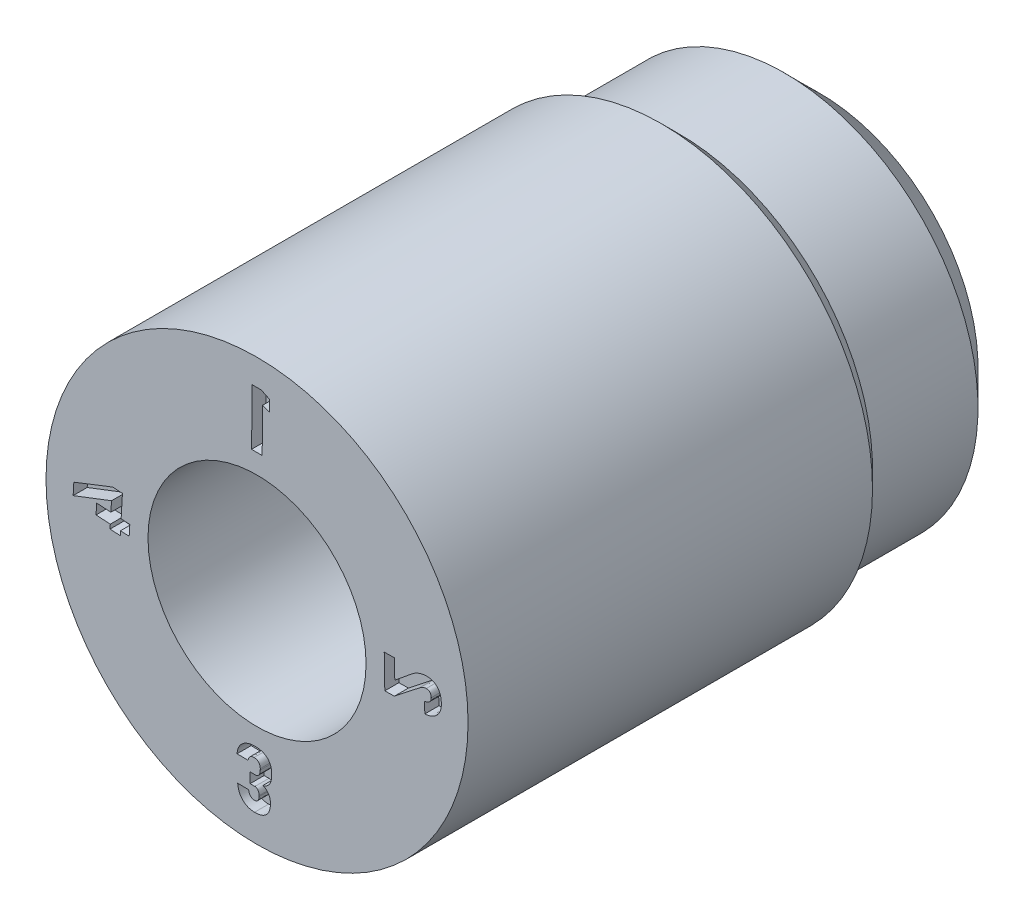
ISO-10303-21;
HEADER;
FILE_DESCRIPTION(('STEP AP214'),'2;1');
FILE_NAME('part.step','',(''),(''),'','','');
FILE_SCHEMA(('AUTOMOTIVE_DESIGN { 1 0 10303 214 1 1 1 1 }'));
ENDSEC;
DATA;
#1=APPLICATION_CONTEXT('core data for automotive mechanical design processes');
#2=APPLICATION_PROTOCOL_DEFINITION('international standard','automotive_design',2000,#1);
#3=PRODUCT_CONTEXT('',#1,'mechanical');
#4=PRODUCT('Part','Part','',(#3));
#5=PRODUCT_RELATED_PRODUCT_CATEGORY('part','',(#4));
#6=PRODUCT_DEFINITION_FORMATION('','',#4);
#7=PRODUCT_DEFINITION_CONTEXT('part definition',#1,'design');
#8=PRODUCT_DEFINITION('design','',#6,#7);
#9=PRODUCT_DEFINITION_SHAPE('','',#8);
#10=(LENGTH_UNIT() NAMED_UNIT(*) SI_UNIT(.MILLI.,.METRE.));
#11=(NAMED_UNIT(*) PLANE_ANGLE_UNIT() SI_UNIT($,.RADIAN.));
#12=(NAMED_UNIT(*) SI_UNIT($,.STERADIAN.) SOLID_ANGLE_UNIT());
#13=UNCERTAINTY_MEASURE_WITH_UNIT(LENGTH_MEASURE(1.E-05),#10,'distance_accuracy_value','');
#14=(GEOMETRIC_REPRESENTATION_CONTEXT(3) GLOBAL_UNCERTAINTY_ASSIGNED_CONTEXT((#13)) GLOBAL_UNIT_ASSIGNED_CONTEXT((#10,
#11,#12)) REPRESENTATION_CONTEXT('',''));
#15=CARTESIAN_POINT('',(0.,0.,0.));
#16=DIRECTION('',(0.,0.,1.));
#17=DIRECTION('',(1.,0.,0.));
#18=AXIS2_PLACEMENT_3D('',#15,#16,#17);
#19=CARTESIAN_POINT('',(0.,0.,-7.49960500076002));
#20=DIRECTION('',(0.,0.,1.));
#21=DIRECTION('',(1.,0.,0.));
#22=AXIS2_PLACEMENT_3D('',#19,#20,#21);
#23=CONICAL_SURFACE('',#22,2.75,0.785398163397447);
#24=CARTESIAN_POINT('',(0.,0.,-7.9999840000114));
#25=DIRECTION('',(0.,0.,-1.));
#26=DIRECTION('',(-1.,0.,0.));
#27=AXIS2_PLACEMENT_3D('',#24,#25,#26);
#28=CIRCLE('',#27,2.24962100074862);
#29=CARTESIAN_POINT('',(-2.24962100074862,0.,-7.9999840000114));
#30=VERTEX_POINT('',#29);
#31=EDGE_CURVE('E11',#30,#30,#28,.T.);
#32=ORIENTED_EDGE('',*,*,#31,.F.);
#33=EDGE_LOOP('',(#32));
#34=FACE_BOUND('',#33,.T.);
#35=CARTESIAN_POINT('',(0.,0.,-7.49960500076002));
#36=DIRECTION('',(0.,0.,-1.));
#37=DIRECTION('',(-1.,0.,0.));
#38=AXIS2_PLACEMENT_3D('',#35,#36,#37);
#39=CIRCLE('',#38,2.75);
#40=CARTESIAN_POINT('',(-2.75,0.,-7.49960500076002));
#41=VERTEX_POINT('',#40);
#42=EDGE_CURVE('E768',#41,#41,#39,.T.);
#43=ORIENTED_EDGE('',*,*,#42,.T.);
#44=EDGE_LOOP('',(#43));
#45=FACE_BOUND('',#44,.T.);
#46=ADVANCED_FACE('F34',(#34,#45),#23,.T.);
#47=CARTESIAN_POINT('',(2.24962100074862,0.,-7.9999840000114));
#48=DIRECTION('',(0.,0.,1.));
#49=DIRECTION('',(1.,0.,0.));
#50=AXIS2_PLACEMENT_3D('',#47,#48,#49);
#51=PLANE('',#50);
#52=CARTESIAN_POINT('',(0.,0.,-7.9999840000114));
#53=DIRECTION('',(0.,0.,-1.));
#54=DIRECTION('',(-1.,0.,0.));
#55=AXIS2_PLACEMENT_3D('',#52,#53,#54);
#56=CIRCLE('',#55,0.8);
#57=CARTESIAN_POINT('',(-0.8,0.,-7.9999840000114));
#58=VERTEX_POINT('',#57);
#59=EDGE_CURVE('E41',#58,#58,#56,.T.);
#60=ORIENTED_EDGE('',*,*,#59,.F.);
#61=EDGE_LOOP('',(#60));
#62=FACE_BOUND('',#61,.T.);
#63=ORIENTED_EDGE('',*,*,#31,.T.);
#64=EDGE_LOOP('',(#63));
#65=FACE_BOUND('',#64,.T.);
#66=ADVANCED_FACE('F821',(#62,#65),#51,.F.);
#67=CARTESIAN_POINT('',(0.,0.,-4.84914349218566));
#68=DIRECTION('',(0.,0.,-1.));
#69=DIRECTION('',(-1.,0.,0.));
#70=AXIS2_PLACEMENT_3D('',#67,#68,#69);
#71=CYLINDRICAL_SURFACE('',#70,0.8);
#72=CARTESIAN_POINT('',(0.,0.,-5.4999840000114));
#73=DIRECTION('',(0.,0.,-1.));
#74=DIRECTION('',(-1.,0.,0.));
#75=AXIS2_PLACEMENT_3D('',#72,#73,#74);
#76=CIRCLE('',#75,0.8);
#77=CARTESIAN_POINT('',(-0.8,0.,-5.4999840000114));
#78=VERTEX_POINT('',#77);
#79=EDGE_CURVE('E814',#78,#78,#76,.T.);
#80=ORIENTED_EDGE('',*,*,#79,.F.);
#81=EDGE_LOOP('',(#80));
#82=FACE_BOUND('',#81,.T.);
#83=ORIENTED_EDGE('',*,*,#59,.T.);
#84=EDGE_LOOP('',(#83));
#85=FACE_BOUND('',#84,.T.);
#86=ADVANCED_FACE('F819',(#82,#85),#71,.F.);
#87=CARTESIAN_POINT('',(0.8,0.,-5.4999840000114));
#88=DIRECTION('',(0.,0.,-1.));
#89=DIRECTION('',(-1.,0.,0.));
#90=AXIS2_PLACEMENT_3D('',#87,#88,#89);
#91=PLANE('',#90);
#92=CARTESIAN_POINT('',(0.,0.,-5.4999840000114));
#93=DIRECTION('',(0.,0.,-1.));
#94=DIRECTION('',(-1.,0.,0.));
#95=AXIS2_PLACEMENT_3D('',#92,#93,#94);
#96=CIRCLE('',#95,1.55);
#97=CARTESIAN_POINT('',(-1.55,0.,-5.4999840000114));
#98=VERTEX_POINT('',#97);
#99=EDGE_CURVE('E811',#98,#98,#96,.T.);
#100=ORIENTED_EDGE('',*,*,#99,.F.);
#101=EDGE_LOOP('',(#100));
#102=FACE_BOUND('',#101,.T.);
#103=ORIENTED_EDGE('',*,*,#79,.T.);
#104=EDGE_LOOP('',(#103));
#105=FACE_BOUND('',#104,.T.);
#106=ADVANCED_FACE('F859',(#102,#105),#91,.F.);
#107=CARTESIAN_POINT('',(0.,0.,-4.84914349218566));
#108=DIRECTION('',(0.,0.,-1.));
#109=DIRECTION('',(-1.,0.,0.));
#110=AXIS2_PLACEMENT_3D('',#107,#108,#109);
#111=CYLINDRICAL_SURFACE('',#110,1.55);
#112=CARTESIAN_POINT('',(0.,0.,0.));
#113=DIRECTION('',(0.,0.,-1.));
#114=DIRECTION('',(-1.,0.,0.));
#115=AXIS2_PLACEMENT_3D('',#112,#113,#114);
#116=CIRCLE('',#115,1.55);
#117=CARTESIAN_POINT('',(-1.55,0.,0.));
#118=VERTEX_POINT('',#117);
#119=EDGE_CURVE('E808',#118,#118,#116,.T.);
#120=ORIENTED_EDGE('',*,*,#119,.F.);
#121=EDGE_LOOP('',(#120));
#122=FACE_BOUND('',#121,.T.);
#123=ORIENTED_EDGE('',*,*,#99,.T.);
#124=EDGE_LOOP('',(#123));
#125=FACE_BOUND('',#124,.T.);
#126=ADVANCED_FACE('F852',(#122,#125),#111,.F.);
#127=CARTESIAN_POINT('',(1.55,0.,0.));
#128=DIRECTION('',(0.,0.,-1.));
#129=DIRECTION('',(-1.,0.,0.));
#130=AXIS2_PLACEMENT_3D('',#127,#128,#129);
#131=PLANE('',#130);
#132=CARTESIAN_POINT('',(-0.0240991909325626,-1.80367304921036,0.));
#133=CARTESIAN_POINT('',(-0.0470301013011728,-1.80362781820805,0.));
#134=CARTESIAN_POINT('',(-0.0810715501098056,-1.80556144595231,0.));
#135=CARTESIAN_POINT('',(-0.124110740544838,-1.81661148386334,0.));
#136=CARTESIAN_POINT('',(-0.1537296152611,-1.8276998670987,0.));
#137=CARTESIAN_POINT('',(-0.180999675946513,-1.84197855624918,0.));
#138=CARTESIAN_POINT('',(-0.205478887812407,-1.85955407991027,0.));
#139=CARTESIAN_POINT('',(-0.22690235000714,-1.88037007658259,0.));
#140=CARTESIAN_POINT('',(-0.245612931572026,-1.90389436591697,0.));
#141=CARTESIAN_POINT('',(-0.260747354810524,-1.93043588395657,0.));
#142=CARTESIAN_POINT('',(-0.276951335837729,-1.96990214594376,0.));
#143=CARTESIAN_POINT('',(-0.281822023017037,-2.00231997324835,0.));
#144=CARTESIAN_POINT('',(-0.283503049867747,-2.02421480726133,0.));
#145=B_SPLINE_CURVE_WITH_KNOTS('',3,(#132,#133,#134,#135,#136,#137,#138,#139,#140,#141,#142,
#143,#144),.UNSPECIFIED.,.F.,.F.,(4,1,1,1,1,1,1,1,1,1,4),(0.,0.181185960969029,0.26664032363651,
0.349465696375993,0.430032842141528,0.508612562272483,0.586172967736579,0.664836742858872,
0.744782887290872,0.8262709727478,1.),.UNSPECIFIED.);
#146=CARTESIAN_POINT('',(-0.0240991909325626,-1.80367304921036,0.));
#147=VERTEX_POINT('',#146);
#148=CARTESIAN_POINT('',(-0.283503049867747,-2.02421480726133,0.));
#149=VERTEX_POINT('',#148);
#150=EDGE_CURVE('E1214',#147,#149,#145,.T.);
#151=ORIENTED_EDGE('',*,*,#150,.F.);
#152=CARTESIAN_POINT('',(0.207953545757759,-2.0274925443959,0.));
#153=CARTESIAN_POINT('',(0.208373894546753,-2.00572691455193,0.));
#154=CARTESIAN_POINT('',(0.205609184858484,-1.97391428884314,0.));
#155=CARTESIAN_POINT('',(0.194747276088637,-1.93399279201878,0.));
#156=CARTESIAN_POINT('',(0.182890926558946,-1.90766423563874,0.));
#157=CARTESIAN_POINT('',(0.16767265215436,-1.88407312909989,0.));
#158=CARTESIAN_POINT('',(0.14939905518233,-1.86304871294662,0.));
#159=CARTESIAN_POINT('',(0.127387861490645,-1.84552405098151,0.));
#160=CARTESIAN_POINT('',(0.102661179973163,-1.83055302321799,0.));
#161=CARTESIAN_POINT('',(0.0748374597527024,-1.81878738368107,0.));
#162=CARTESIAN_POINT('',(0.0327144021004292,-1.806981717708,0.));
#163=CARTESIAN_POINT('',(-0.00104265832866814,-1.80400725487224,0.));
#164=CARTESIAN_POINT('',(-0.0240991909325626,-1.80367304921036,0.));
#165=B_SPLINE_CURVE_WITH_KNOTS('',3,(#152,#153,#154,#155,#156,#157,#158,#159,#160,#161,#162,
#163,#164),.UNSPECIFIED.,.F.,.F.,(4,1,1,1,1,1,1,1,1,1,4),(0.,0.178128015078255,
0.259598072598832,0.337592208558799,0.413473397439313,0.48870505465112,0.564513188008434,
0.6428086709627,0.724671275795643,0.810985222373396,1.),.UNSPECIFIED.);
#166=CARTESIAN_POINT('',(0.207953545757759,-2.0274925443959,0.));
#167=VERTEX_POINT('',#166);
#168=EDGE_CURVE('E48',#167,#147,#165,.T.);
#169=ORIENTED_EDGE('',*,*,#168,.F.);
#170=DIRECTION('',(0.0120658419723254,0.999927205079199,0.));
#171=VECTOR('',#170,1.);
#172=CARTESIAN_POINT('',(0.207662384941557,-2.0516217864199,0.));
#173=LINE('',#172,#171);
#174=CARTESIAN_POINT('',(0.207662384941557,-2.0516217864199,0.));
#175=VERTEX_POINT('',#174);
#176=EDGE_CURVE('E431',#175,#167,#173,.T.);
#177=ORIENTED_EDGE('',*,*,#176,.F.);
#178=CARTESIAN_POINT('',(0.0841805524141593,-2.23111861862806,0.));
#179=CARTESIAN_POINT('',(0.0935164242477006,-2.22913834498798,0.));
#180=CARTESIAN_POINT('',(0.107011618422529,-2.22485073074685,0.));
#181=CARTESIAN_POINT('',(0.124048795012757,-2.21726427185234,0.));
#182=CARTESIAN_POINT('',(0.13574218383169,-2.21023196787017,0.));
#183=CARTESIAN_POINT('',(0.146706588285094,-2.20227607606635,0.));
#184=CARTESIAN_POINT('',(0.156756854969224,-2.19306872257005,0.));
#185=CARTESIAN_POINT('',(0.166242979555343,-2.18308642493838,0.));
#186=CARTESIAN_POINT('',(0.174671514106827,-2.17182890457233,0.));
#187=CARTESIAN_POINT('',(0.182046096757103,-2.1595860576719,0.));
#188=CARTESIAN_POINT('',(0.188918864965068,-2.14668681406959,0.));
#189=CARTESIAN_POINT('',(0.194356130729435,-2.13277209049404,0.));
#190=CARTESIAN_POINT('',(0.199025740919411,-2.11813655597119,0.));
#191=CARTESIAN_POINT('',(0.202656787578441,-2.1026872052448,0.));
#192=CARTESIAN_POINT('',(0.206317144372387,-2.08050745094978,0.));
#193=CARTESIAN_POINT('',(0.207464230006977,-2.06331958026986,0.));
#194=CARTESIAN_POINT('',(0.207662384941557,-2.0516217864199,0.));
#195=B_SPLINE_CURVE_WITH_KNOTS('',3,(#178,#179,#180,#181,#182,#183,#184,#185,#186,#187,#188,
#189,#190,#191,#192,#193,#194),.UNSPECIFIED.,.F.,.F.,(4,1,1,1,1,1,1,1,1,1,1,1,1,1,4),(0.,
0.120545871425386,0.178653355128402,0.235490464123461,0.292828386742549,0.349719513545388,
0.407664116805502,0.466799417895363,0.527168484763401,0.588350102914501,0.651429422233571,
0.715828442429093,0.782566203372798,0.85198001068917,1.),.UNSPECIFIED.);
#196=CARTESIAN_POINT('',(0.0841805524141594,-2.23111861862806,0.));
#197=VERTEX_POINT('',#196);
#198=EDGE_CURVE('E434',#197,#175,#195,.T.);
#199=ORIENTED_EDGE('',*,*,#198,.F.);
#200=CARTESIAN_POINT('',(0.189845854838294,-2.391036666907,0.));
#201=CARTESIAN_POINT('',(0.190082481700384,-2.37353634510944,0.));
#202=CARTESIAN_POINT('',(0.187214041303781,-2.34759456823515,0.));
#203=CARTESIAN_POINT('',(0.175769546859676,-2.31537985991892,0.));
#204=CARTESIAN_POINT('',(0.163703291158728,-2.29358351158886,0.));
#205=CARTESIAN_POINT('',(0.148208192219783,-2.27406893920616,0.));
#206=CARTESIAN_POINT('',(0.123382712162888,-2.25044597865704,0.));
#207=CARTESIAN_POINT('',(0.10029005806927,-2.23792693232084,0.));
#208=CARTESIAN_POINT('',(0.0841805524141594,-2.23111861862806,0.));
#209=B_SPLINE_CURVE_WITH_KNOTS('',3,(#200,#201,#202,#203,#204,#205,#206,#207,#208),
.UNSPECIFIED.,.F.,.F.,(4,1,1,1,1,1,4),(0.,0.256895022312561,0.378293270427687,0.499432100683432,
0.620591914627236,0.742541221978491,1.),.UNSPECIFIED.);
#210=CARTESIAN_POINT('',(0.189845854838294,-2.391036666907,0.));
#211=VERTEX_POINT('',#210);
#212=EDGE_CURVE('E1115',#211,#197,#209,.T.);
#213=ORIENTED_EDGE('',*,*,#212,.F.);
#214=DIRECTION('',(0.0120658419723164,0.999927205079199,0.));
#215=VECTOR('',#214,1.);
#216=CARTESIAN_POINT('',(0.189554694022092,-2.415165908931,0.));
#217=LINE('',#216,#215);
#218=CARTESIAN_POINT('',(0.189554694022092,-2.415165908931,0.));
#219=VERTEX_POINT('',#218);
#220=EDGE_CURVE('E1123',#219,#211,#217,.T.);
#221=ORIENTED_EDGE('',*,*,#220,.F.);
#222=CARTESIAN_POINT('',(-0.0355325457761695,-2.62027706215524,0.));
#223=CARTESIAN_POINT('',(-0.018771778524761,-2.62066356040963,0.));
#224=CARTESIAN_POINT('',(0.00568758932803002,-2.6191673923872,0.));
#225=CARTESIAN_POINT('',(0.0371173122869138,-2.61408822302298,0.));
#226=CARTESIAN_POINT('',(0.058582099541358,-2.60845084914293,0.));
#227=CARTESIAN_POINT('',(0.0784977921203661,-2.60092699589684,0.));
#228=CARTESIAN_POINT('',(0.0970801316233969,-2.59195780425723,0.));
#229=CARTESIAN_POINT('',(0.114031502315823,-2.58102622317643,0.));
#230=CARTESIAN_POINT('',(0.129633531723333,-2.56859691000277,0.));
#231=CARTESIAN_POINT('',(0.143339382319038,-2.55428037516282,0.));
#232=CARTESIAN_POINT('',(0.155578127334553,-2.53878712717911,0.));
#233=CARTESIAN_POINT('',(0.165964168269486,-2.52172473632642,0.));
#234=CARTESIAN_POINT('',(0.174073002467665,-2.50308820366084,0.));
#235=CARTESIAN_POINT('',(0.180988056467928,-2.48319561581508,0.));
#236=CARTESIAN_POINT('',(0.187314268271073,-2.45385493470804,0.));
#237=CARTESIAN_POINT('',(0.189343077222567,-2.4308690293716,0.));
#238=CARTESIAN_POINT('',(0.189554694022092,-2.415165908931,0.));
#239=B_SPLINE_CURVE_WITH_KNOTS('',3,(#222,#223,#224,#225,#226,#227,#228,#229,#230,#231,#232,
#233,#234,#235,#236,#237,#238),.UNSPECIFIED.,.F.,.F.,(4,1,1,1,1,1,1,1,1,1,1,1,1,1,4),(0.,
0.145068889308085,0.211710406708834,0.275453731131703,0.336893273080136,0.39583596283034,
0.45379336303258,0.511222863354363,0.568177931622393,0.625031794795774,0.681947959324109,
0.740596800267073,0.80073552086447,0.864053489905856,1.),.UNSPECIFIED.);
#240=CARTESIAN_POINT('',(-0.0355325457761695,-2.62027706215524,0.));
#241=VERTEX_POINT('',#240);
#242=EDGE_CURVE('E1129',#241,#219,#239,.T.);
#243=ORIENTED_EDGE('',*,*,#242,.F.);
#244=CARTESIAN_POINT('',(-0.275045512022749,-2.38207824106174,0.));
#245=CARTESIAN_POINT('',(-0.273440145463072,-2.40522039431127,0.));
#246=CARTESIAN_POINT('',(-0.267367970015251,-2.43886986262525,0.));
#247=CARTESIAN_POINT('',(-0.252666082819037,-2.48099421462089,0.));
#248=CARTESIAN_POINT('',(-0.238022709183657,-2.50901600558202,0.));
#249=CARTESIAN_POINT('',(-0.220782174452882,-2.5342790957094,0.));
#250=CARTESIAN_POINT('',(-0.200928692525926,-2.55671318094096,0.));
#251=CARTESIAN_POINT('',(-0.178272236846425,-2.57573292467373,0.));
#252=CARTESIAN_POINT('',(-0.153256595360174,-2.59168084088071,0.));
#253=CARTESIAN_POINT('',(-0.126126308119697,-2.60400888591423,0.));
#254=CARTESIAN_POINT('',(-0.0872212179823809,-2.61640022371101,0.));
#255=CARTESIAN_POINT('',(-0.0563721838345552,-2.62009194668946,0.));
#256=CARTESIAN_POINT('',(-0.0355325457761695,-2.62027706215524,0.));
#257=B_SPLINE_CURVE_WITH_KNOTS('',3,(#244,#245,#246,#247,#248,#249,#250,#251,#252,#253,#254,
#255,#256),.UNSPECIFIED.,.F.,.F.,(4,1,1,1,1,1,1,1,1,1,4),(0.,0.185509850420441,
0.272282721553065,0.356205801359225,0.43783538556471,0.516628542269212,0.595241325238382,
0.673882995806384,0.753403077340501,0.833124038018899,1.),.UNSPECIFIED.);
#258=CARTESIAN_POINT('',(-0.275045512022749,-2.38207824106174,0.));
#259=VERTEX_POINT('',#258);
#260=EDGE_CURVE('E1134',#259,#241,#257,.T.);
#261=ORIENTED_EDGE('',*,*,#260,.F.);
#262=DIRECTION('',(-0.999901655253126,0.0140242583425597,0.));
#263=VECTOR('',#262,1.);
#264=CARTESIAN_POINT('',(-0.119843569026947,-2.38425504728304,0.));
#265=LINE('',#264,#263);
#266=CARTESIAN_POINT('',(-0.119843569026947,-2.38425504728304,0.));
#267=VERTEX_POINT('',#266);
#268=EDGE_CURVE('E1142',#267,#259,#265,.T.);
#269=ORIENTED_EDGE('',*,*,#268,.F.);
#270=CARTESIAN_POINT('',(-0.0391221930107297,-2.4737342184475,0.));
#271=CARTESIAN_POINT('',(-0.0456649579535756,-2.4735741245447,0.));
#272=CARTESIAN_POINT('',(-0.0555501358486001,-2.47252988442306,0.));
#273=CARTESIAN_POINT('',(-0.0676186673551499,-2.46758429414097,0.));
#274=CARTESIAN_POINT('',(-0.0762327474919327,-2.46301199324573,0.));
#275=CARTESIAN_POINT('',(-0.084212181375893,-2.45703699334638,0.));
#276=CARTESIAN_POINT('',(-0.09165103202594,-2.4499411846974,0.));
#277=CARTESIAN_POINT('',(-0.0981938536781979,-2.44155340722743,0.));
#278=CARTESIAN_POINT('',(-0.104273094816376,-2.43216799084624,0.));
#279=CARTESIAN_POINT('',(-0.109453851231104,-2.42161526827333,0.));
#280=CARTESIAN_POINT('',(-0.115598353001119,-2.40579314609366,0.));
#281=CARTESIAN_POINT('',(-0.118211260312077,-2.39297213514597,0.));
#282=CARTESIAN_POINT('',(-0.119843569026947,-2.38425504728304,0.));
#283=B_SPLINE_CURVE_WITH_KNOTS('',3,(#270,#271,#272,#273,#274,#275,#276,#277,#278,#279,#280,
#281,#282),.UNSPECIFIED.,.F.,.F.,(4,1,1,1,1,1,1,1,1,1,4),(0.,0.150011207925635,
0.222512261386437,0.296199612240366,0.371809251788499,0.448975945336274,0.529871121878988,
0.613710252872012,0.703489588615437,0.797355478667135,1.),.UNSPECIFIED.);
#284=CARTESIAN_POINT('',(-0.0391221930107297,-2.4737342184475,0.));
#285=VERTEX_POINT('',#284);
#286=EDGE_CURVE('E1148',#285,#267,#283,.T.);
#287=ORIENTED_EDGE('',*,*,#286,.F.);
#288=CARTESIAN_POINT('',(0.0280542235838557,-2.39782406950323,0.));
#289=CARTESIAN_POINT('',(0.0278895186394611,-2.40879818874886,0.));
#290=CARTESIAN_POINT('',(0.0258283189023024,-2.42462187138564,0.));
#291=CARTESIAN_POINT('',(0.0182339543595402,-2.44352791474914,0.));
#292=CARTESIAN_POINT('',(0.0102742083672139,-2.45464812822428,0.));
#293=CARTESIAN_POINT('',(0.000433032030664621,-2.46343075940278,0.));
#294=CARTESIAN_POINT('',(-0.015714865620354,-2.4719259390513,0.));
#295=CARTESIAN_POINT('',(-0.0296953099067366,-2.4738988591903,0.));
#296=CARTESIAN_POINT('',(-0.0391221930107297,-2.4737342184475,0.));
#297=B_SPLINE_CURVE_WITH_KNOTS('',3,(#288,#289,#290,#291,#292,#293,#294,#295,#296),
.UNSPECIFIED.,.F.,.F.,(4,1,1,1,1,1,4),(0.,0.286763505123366,0.411667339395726,0.528163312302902,
0.640613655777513,0.753081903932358,1.),.UNSPECIFIED.);
#298=CARTESIAN_POINT('',(0.0280542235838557,-2.39782406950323,0.));
#299=VERTEX_POINT('',#298);
#300=EDGE_CURVE('E1153',#299,#285,#297,.T.);
#301=ORIENTED_EDGE('',*,*,#300,.F.);
#302=DIRECTION('',(-0.0138142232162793,-0.999904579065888,0.));
#303=VECTOR('',#302,1.);
#304=CARTESIAN_POINT('',(0.0282456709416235,-2.38396667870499,0.));
#305=LINE('',#304,#303);
#306=CARTESIAN_POINT('',(0.0282456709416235,-2.38396667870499,0.));
#307=VERTEX_POINT('',#306);
#308=EDGE_CURVE('E1161',#307,#299,#305,.T.);
#309=ORIENTED_EDGE('',*,*,#308,.F.);
#310=CARTESIAN_POINT('',(-0.0307782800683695,-2.30058753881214,0.));
#311=CARTESIAN_POINT('',(-0.0220232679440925,-2.30041379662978,0.));
#312=CARTESIAN_POINT('',(-0.0091216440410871,-2.30343312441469,0.));
#313=CARTESIAN_POINT('',(0.0052824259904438,-2.31309503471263,0.));
#314=CARTESIAN_POINT('',(0.0138973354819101,-2.32306059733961,0.));
#315=CARTESIAN_POINT('',(0.0206050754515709,-2.33531400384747,0.));
#316=CARTESIAN_POINT('',(0.0270855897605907,-2.35561634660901,0.));
#317=CARTESIAN_POINT('',(0.0286083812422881,-2.3723280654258,0.));
#318=CARTESIAN_POINT('',(0.0282456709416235,-2.38396667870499,0.));
#319=B_SPLINE_CURVE_WITH_KNOTS('',3,(#310,#311,#312,#313,#314,#315,#316,#317,#318),
.UNSPECIFIED.,.F.,.F.,(4,1,1,1,1,1,4),(0.,0.227254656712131,0.334902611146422,0.447139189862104,
0.567132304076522,0.696605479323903,1.),.UNSPECIFIED.);
#320=CARTESIAN_POINT('',(-0.0307782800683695,-2.30058753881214,0.));
#321=VERTEX_POINT('',#320);
#322=EDGE_CURVE('E1167',#321,#307,#319,.T.);
#323=ORIENTED_EDGE('',*,*,#322,.F.);
#324=DIRECTION('',(0.999908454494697,-0.0135308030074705,0.));
#325=VECTOR('',#324,1.);
#326=CARTESIAN_POINT('',(-0.0984354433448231,-2.29967199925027,0.));
#327=LINE('',#326,#325);
#328=CARTESIAN_POINT('',(-0.0984354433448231,-2.29967199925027,0.));
#329=VERTEX_POINT('',#328);
#330=EDGE_CURVE('E1172',#329,#321,#327,.T.);
#331=ORIENTED_EDGE('',*,*,#330,.F.);
#332=DIRECTION('',(-0.0143554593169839,-0.999896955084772,0.));
#333=VECTOR('',#332,1.);
#334=CARTESIAN_POINT('',(-0.096350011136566,-2.15441594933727,0.));
#335=LINE('',#334,#333);
#336=CARTESIAN_POINT('',(-0.096350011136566,-2.15441594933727,0.));
#337=VERTEX_POINT('',#336);
#338=EDGE_CURVE('E1178',#337,#329,#335,.T.);
#339=ORIENTED_EDGE('',*,*,#338,.F.);
#340=DIRECTION('',(-0.999908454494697,0.013530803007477,0.));
#341=VECTOR('',#340,1.);
#342=CARTESIAN_POINT('',(-0.0286928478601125,-2.15533148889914,0.));
#343=LINE('',#342,#341);
#344=CARTESIAN_POINT('',(-0.0286928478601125,-2.15533148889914,0.));
#345=VERTEX_POINT('',#344);
#346=EDGE_CURVE('E1181',#345,#337,#343,.T.);
#347=ORIENTED_EDGE('',*,*,#346,.F.);
#348=CARTESIAN_POINT('',(0.0457998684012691,-2.06117983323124,0.));
#349=CARTESIAN_POINT('',(0.0454902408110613,-2.07471250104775,0.));
#350=CARTESIAN_POINT('',(0.0436228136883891,-2.09425088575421,0.));
#351=CARTESIAN_POINT('',(0.0351498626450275,-2.11761025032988,0.));
#352=CARTESIAN_POINT('',(0.0265370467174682,-2.13142766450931,0.));
#353=CARTESIAN_POINT('',(0.0157046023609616,-2.14234509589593,0.));
#354=CARTESIAN_POINT('',(-0.0022007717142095,-2.15297284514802,0.));
#355=CARTESIAN_POINT('',(-0.0180504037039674,-2.155544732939,0.));
#356=CARTESIAN_POINT('',(-0.0286928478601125,-2.15533148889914,0.));
#357=B_SPLINE_CURVE_WITH_KNOTS('',3,(#348,#349,#350,#351,#352,#353,#354,#355,#356),
.UNSPECIFIED.,.F.,.F.,(4,1,1,1,1,1,4),(0.,0.299739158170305,0.427976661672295,0.545251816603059,
0.65640914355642,0.764247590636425,1.),.UNSPECIFIED.);
#358=CARTESIAN_POINT('',(0.0457998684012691,-2.06117983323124,0.));
#359=VERTEX_POINT('',#358);
#360=EDGE_CURVE('E1184',#359,#345,#357,.T.);
#361=ORIENTED_EDGE('',*,*,#360,.F.);
#362=DIRECTION('',(-0.00818918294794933,-0.999966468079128,0.));
#363=VECTOR('',#362,1.);
#364=CARTESIAN_POINT('',(0.0459534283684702,-2.04242890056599,0.));
#365=LINE('',#364,#363);
#366=CARTESIAN_POINT('',(0.0459534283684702,-2.04242890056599,0.));
#367=VERTEX_POINT('',#366);
#368=EDGE_CURVE('E1189',#367,#359,#365,.T.);
#369=ORIENTED_EDGE('',*,*,#368,.F.);
#370=CARTESIAN_POINT('',(-0.0425158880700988,-1.94981595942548,0.));
#371=CARTESIAN_POINT('',(-0.0296918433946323,-1.95011549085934,0.));
#372=CARTESIAN_POINT('',(-0.0108246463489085,-1.95254927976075,0.));
#373=CARTESIAN_POINT('',(0.0110401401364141,-1.96340569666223,0.));
#374=CARTESIAN_POINT('',(0.0239685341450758,-1.97442084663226,0.));
#375=CARTESIAN_POINT('',(0.0343414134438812,-1.98789639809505,0.));
#376=CARTESIAN_POINT('',(0.0439311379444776,-2.01047436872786,0.));
#377=CARTESIAN_POINT('',(0.0463863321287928,-2.02936814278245,0.));
#378=CARTESIAN_POINT('',(0.0459534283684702,-2.04242890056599,0.));
#379=B_SPLINE_CURVE_WITH_KNOTS('',3,(#370,#371,#372,#373,#374,#375,#376,#377,#378),
.UNSPECIFIED.,.F.,.F.,(4,1,1,1,1,1,4),(0.,0.26585432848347,0.383627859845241,0.498411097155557,
0.613194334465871,0.730967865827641,1.),.UNSPECIFIED.);
#380=CARTESIAN_POINT('',(-0.0425158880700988,-1.94981595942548,0.));
#381=VERTEX_POINT('',#380);
#382=EDGE_CURVE('E1195',#381,#367,#379,.T.);
#383=ORIENTED_EDGE('',*,*,#382,.F.);
#384=CARTESIAN_POINT('',(-0.127812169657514,-2.02640412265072,0.));
#385=CARTESIAN_POINT('',(-0.126488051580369,-2.01868416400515,0.));
#386=CARTESIAN_POINT('',(-0.124072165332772,-2.00736140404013,0.));
#387=CARTESIAN_POINT('',(-0.118102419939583,-1.99359120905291,0.));
#388=CARTESIAN_POINT('',(-0.112791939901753,-1.98455155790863,0.));
#389=CARTESIAN_POINT('',(-0.106635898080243,-1.97642801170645,0.));
#390=CARTESIAN_POINT('',(-0.0997169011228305,-1.96929430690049,0.));
#391=CARTESIAN_POINT('',(-0.0918348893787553,-1.96337748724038,0.));
#392=CARTESIAN_POINT('',(-0.0833697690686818,-1.95834136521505,0.));
#393=CARTESIAN_POINT('',(-0.0741544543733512,-1.95427547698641,0.));
#394=CARTESIAN_POINT('',(-0.0605113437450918,-1.95074932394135,0.));
#395=CARTESIAN_POINT('',(-0.0498370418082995,-1.94948362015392,0.));
#396=CARTESIAN_POINT('',(-0.0425158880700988,-1.94981595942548,0.));
#397=B_SPLINE_CURVE_WITH_KNOTS('',3,(#384,#385,#386,#387,#388,#389,#390,#391,#392,#393,#394,
#395,#396),.UNSPECIFIED.,.F.,.F.,(4,1,1,1,1,1,1,1,1,1,4),(0.,0.186129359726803,
0.272233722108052,0.35467656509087,0.43403317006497,0.513316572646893,0.589352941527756,
0.666901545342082,0.746425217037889,0.827108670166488,1.),.UNSPECIFIED.);
#398=CARTESIAN_POINT('',(-0.127812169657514,-2.02640412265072,0.));
#399=VERTEX_POINT('',#398);
#400=EDGE_CURVE('E1200',#399,#381,#397,.T.);
#401=ORIENTED_EDGE('',*,*,#400,.F.);
#402=DIRECTION('',(0.99990114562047,-0.0140605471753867,0.));
#403=VECTOR('',#402,1.);
#404=CARTESIAN_POINT('',(-0.283503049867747,-2.02421480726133,0.));
#405=LINE('',#404,#403);
#406=EDGE_CURVE('E1208',#149,#399,#405,.T.);
#407=ORIENTED_EDGE('',*,*,#406,.F.);
#408=EDGE_LOOP('',(#151,#169,#177,#199,#213,#221,#243,#261,#269,#287,#301,#309,#323,#331,#339,
#347,#361,#369,#383,#401,#407));
#409=FACE_BOUND('',#408,.T.);
#410=DIRECTION('',(0.785596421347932,0.618739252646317,0.));
#411=VECTOR('',#410,1.);
#412=CARTESIAN_POINT('',(1.95245488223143,-0.197374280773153,0.));
#413=LINE('',#412,#411);
#414=CARTESIAN_POINT('',(1.95245488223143,-0.197374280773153,0.));
#415=VERTEX_POINT('',#414);
#416=CARTESIAN_POINT('',(2.30881385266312,0.0832956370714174,0.));
#417=VERTEX_POINT('',#416);
#418=EDGE_CURVE('E507',#415,#417,#413,.T.);
#419=ORIENTED_EDGE('',*,*,#418,.F.);
#420=DIRECTION('',(0.999841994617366,0.0177759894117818,0.));
#421=VECTOR('',#420,1.);
#422=CARTESIAN_POINT('',(1.81648818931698,-0.199791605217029,0.));
#423=LINE('',#422,#421);
#424=CARTESIAN_POINT('',(1.81648818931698,-0.199791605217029,0.));
#425=VERTEX_POINT('',#424);
#426=EDGE_CURVE('E56',#425,#415,#423,.T.);
#427=ORIENTED_EDGE('',*,*,#426,.F.);
#428=DIRECTION('',(0.0169888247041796,-0.999855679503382,0.));
#429=VECTOR('',#428,1.);
#430=CARTESIAN_POINT('',(1.80844919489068,0.273333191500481,0.));
#431=LINE('',#430,#429);
#432=CARTESIAN_POINT('',(1.80844919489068,0.273333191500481,0.));
#433=VERTEX_POINT('',#432);
#434=EDGE_CURVE('E583',#433,#425,#431,.T.);
#435=ORIENTED_EDGE('',*,*,#434,.F.);
#436=DIRECTION('',(-0.999842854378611,-0.0177275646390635,0.));
#437=VECTOR('',#436,1.);
#438=CARTESIAN_POINT('',(1.95370881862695,0.275908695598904,0.));
#439=LINE('',#438,#437);
#440=CARTESIAN_POINT('',(1.95370881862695,0.275908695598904,0.));
#441=VERTEX_POINT('',#440);
#442=EDGE_CURVE('E580',#441,#433,#439,.T.);
#443=ORIENTED_EDGE('',*,*,#442,.F.);
#444=DIRECTION('',(-0.0172700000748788,0.999850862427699,0.));
#445=VECTOR('',#444,1.);
#446=CARTESIAN_POINT('',(1.95843123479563,0.00250326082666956,0.));
#447=LINE('',#446,#445);
#448=CARTESIAN_POINT('',(1.95843123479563,0.00250326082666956,0.));
#449=VERTEX_POINT('',#448);
#450=EDGE_CURVE('E577',#449,#441,#447,.T.);
#451=ORIENTED_EDGE('',*,*,#450,.F.);
#452=DIRECTION('',(-0.773410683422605,-0.633905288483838,0.));
#453=VECTOR('',#452,1.);
#454=CARTESIAN_POINT('',(2.20383846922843,0.203644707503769,0.));
#455=LINE('',#454,#453);
#456=CARTESIAN_POINT('',(2.20383846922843,0.203644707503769,0.));
#457=VERTEX_POINT('',#456);
#458=EDGE_CURVE('E571',#457,#449,#455,.T.);
#459=ORIENTED_EDGE('',*,*,#458,.F.);
#460=CARTESIAN_POINT('',(2.4075851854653,0.279203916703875,0.));
#461=CARTESIAN_POINT('',(2.3894232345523,0.278962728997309,0.));
#462=CARTESIAN_POINT('',(2.36208162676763,0.276113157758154,0.));
#463=CARTESIAN_POINT('',(2.32632595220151,0.267401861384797,0.));
#464=CARTESIAN_POINT('',(2.29968748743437,0.258678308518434,0.));
#465=CARTESIAN_POINT('',(2.27377190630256,0.247958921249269,0.));
#466=CARTESIAN_POINT('',(2.24096479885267,0.230796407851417,0.));
#467=CARTESIAN_POINT('',(2.21805103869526,0.215297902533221,0.));
#468=CARTESIAN_POINT('',(2.20383846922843,0.203644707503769,0.));
#469=B_SPLINE_CURVE_WITH_KNOTS('',3,(#460,#461,#462,#463,#464,#465,#466,#467,#468),
.UNSPECIFIED.,.F.,.F.,(4,1,1,1,1,1,4),(0.,0.246243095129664,0.371118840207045,0.498466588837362,
0.626038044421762,0.7509703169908,1.),.UNSPECIFIED.);
#470=CARTESIAN_POINT('',(2.4075851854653,0.279203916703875,0.));
#471=VERTEX_POINT('',#470);
#472=EDGE_CURVE('E566',#471,#457,#469,.T.);
#473=ORIENTED_EDGE('',*,*,#472,.F.);
#474=DIRECTION('',(-0.999402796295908,-0.0345550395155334,0.));
#475=VECTOR('',#474,1.);
#476=CARTESIAN_POINT('',(2.40823692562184,0.279226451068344,0.));
#477=LINE('',#476,#475);
#478=CARTESIAN_POINT('',(2.40823692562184,0.279226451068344,0.));
#479=VERTEX_POINT('',#478);
#480=EDGE_CURVE('E560',#479,#471,#477,.T.);
#481=ORIENTED_EDGE('',*,*,#480,.F.);
#482=CARTESIAN_POINT('',(2.62085574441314,0.0462876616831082,0.));
#483=CARTESIAN_POINT('',(2.62022986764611,0.0694707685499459,0.));
#484=CARTESIAN_POINT('',(2.61743148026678,0.10335977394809,0.));
#485=CARTESIAN_POINT('',(2.6061100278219,0.145708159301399,0.));
#486=CARTESIAN_POINT('',(2.59491417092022,0.173585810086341,0.));
#487=CARTESIAN_POINT('',(2.58074725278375,0.198429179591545,0.));
#488=CARTESIAN_POINT('',(2.56401236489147,0.220373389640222,0.));
#489=CARTESIAN_POINT('',(2.54409102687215,0.238766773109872,0.));
#490=CARTESIAN_POINT('',(2.52175196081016,0.254220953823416,0.));
#491=CARTESIAN_POINT('',(2.49663991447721,0.265859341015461,0.));
#492=CARTESIAN_POINT('',(2.4590257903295,0.277226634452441,0.));
#493=CARTESIAN_POINT('',(2.42878707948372,0.279545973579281,0.));
#494=CARTESIAN_POINT('',(2.40823692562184,0.279226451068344,0.));
#495=B_SPLINE_CURVE_WITH_KNOTS('',3,(#482,#483,#484,#485,#486,#487,#488,#489,#490,#491,#492,
#493,#494),.UNSPECIFIED.,.F.,.F.,(4,1,1,1,1,1,1,1,1,1,4),(0.,0.19463020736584,0.282982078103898,
0.366380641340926,0.445603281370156,0.521924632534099,0.596615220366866,0.671832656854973,
0.748599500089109,0.827500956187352,1.),.UNSPECIFIED.);
#496=CARTESIAN_POINT('',(2.62085574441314,0.0462876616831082,0.));
#497=VERTEX_POINT('',#496);
#498=EDGE_CURVE('E552',#497,#479,#495,.T.);
#499=ORIENTED_EDGE('',*,*,#498,.F.);
#500=CARTESIAN_POINT('',(2.38565583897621,-0.200014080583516,0.));
#501=CARTESIAN_POINT('',(2.40914041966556,-0.198225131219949,0.));
#502=CARTESIAN_POINT('',(2.44326650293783,-0.192142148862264,0.));
#503=CARTESIAN_POINT('',(2.48570494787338,-0.177019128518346,0.));
#504=CARTESIAN_POINT('',(2.51374094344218,-0.162371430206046,0.));
#505=CARTESIAN_POINT('',(2.53891000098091,-0.144970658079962,0.));
#506=CARTESIAN_POINT('',(2.56114395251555,-0.124964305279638,0.));
#507=CARTESIAN_POINT('',(2.57975459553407,-0.101891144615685,0.));
#508=CARTESIAN_POINT('',(2.59530826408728,-0.0765161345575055,0.));
#509=CARTESIAN_POINT('',(2.60720739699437,-0.0486484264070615,0.));
#510=CARTESIAN_POINT('',(2.61878811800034,-0.0079423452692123,0.));
#511=CARTESIAN_POINT('',(2.62129526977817,0.0244242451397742,0.));
#512=CARTESIAN_POINT('',(2.62085574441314,0.0462876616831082,0.));
#513=B_SPLINE_CURVE_WITH_KNOTS('',3,(#500,#501,#502,#503,#504,#505,#506,#507,#508,#509,#510,
#511,#512),.UNSPECIFIED.,.F.,.F.,(4,1,1,1,1,1,1,1,1,1,4),(0.,0.185636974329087,
0.271683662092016,0.354290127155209,0.434282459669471,0.512411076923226,0.589241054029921,
0.66720381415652,0.746365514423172,0.827400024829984,1.),.UNSPECIFIED.);
#514=CARTESIAN_POINT('',(2.38565583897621,-0.200014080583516,0.));
#515=VERTEX_POINT('',#514);
#516=EDGE_CURVE('E547',#515,#497,#513,.T.);
#517=ORIENTED_EDGE('',*,*,#516,.F.);
#518=DIRECTION('',(0.999402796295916,0.0345550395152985,0.));
#519=VECTOR('',#518,1.);
#520=CARTESIAN_POINT('',(2.38500409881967,-0.200036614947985,0.));
#521=LINE('',#520,#519);
#522=CARTESIAN_POINT('',(2.38500409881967,-0.200036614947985,0.));
#523=VERTEX_POINT('',#522);
#524=EDGE_CURVE('E544',#523,#515,#521,.T.);
#525=ORIENTED_EDGE('',*,*,#524,.F.);
#526=DIRECTION('',(0.0166305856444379,-0.999861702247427,0.));
#527=VECTOR('',#526,1.);
#528=CARTESIAN_POINT('',(2.38243335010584,-0.0454784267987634,0.));
#529=LINE('',#528,#527);
#530=CARTESIAN_POINT('',(2.38243335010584,-0.0454784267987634,0.));
#531=VERTEX_POINT('',#530);
#532=EDGE_CURVE('E541',#531,#523,#529,.T.);
#533=ORIENTED_EDGE('',*,*,#532,.F.);
#534=DIRECTION('',(-0.999402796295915,-0.0345550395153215,0.));
#535=VECTOR('',#534,1.);
#536=CARTESIAN_POINT('',(2.38308509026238,-0.0454558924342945,0.));
#537=LINE('',#536,#535);
#538=CARTESIAN_POINT('',(2.38308509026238,-0.0454558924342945,0.));
#539=VERTEX_POINT('',#538);
#540=EDGE_CURVE('E535',#539,#531,#537,.T.);
#541=ORIENTED_EDGE('',*,*,#540,.F.);
#542=CARTESIAN_POINT('',(2.47555668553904,0.0448527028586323,0.));
#543=CARTESIAN_POINT('',(2.47580794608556,0.0333823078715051,0.));
#544=CARTESIAN_POINT('',(2.47351158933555,0.0161578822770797,0.));
#545=CARTESIAN_POINT('',(2.46297240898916,-0.00379537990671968,0.));
#546=CARTESIAN_POINT('',(2.452259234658,-0.0165490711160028,0.));
#547=CARTESIAN_POINT('',(2.43880939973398,-0.0273814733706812,0.));
#548=CARTESIAN_POINT('',(2.41608305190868,-0.0390661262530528,0.));
#549=CARTESIAN_POINT('',(2.39672699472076,-0.0438589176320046,0.));
#550=CARTESIAN_POINT('',(2.38308509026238,-0.0454558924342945,0.));
#551=B_SPLINE_CURVE_WITH_KNOTS('',3,(#542,#543,#544,#545,#546,#547,#548,#549,#550),
.UNSPECIFIED.,.F.,.F.,(4,1,1,1,1,1,4),(0.,0.24113852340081,0.35370003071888,0.468068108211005,
0.58747589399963,0.712595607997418,1.),.UNSPECIFIED.);
#552=CARTESIAN_POINT('',(2.47555668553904,0.0448527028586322,0.));
#553=VERTEX_POINT('',#552);
#554=EDGE_CURVE('E527',#553,#539,#551,.T.);
#555=ORIENTED_EDGE('',*,*,#554,.F.);
#556=CARTESIAN_POINT('',(2.40658826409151,0.124032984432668,0.));
#557=CARTESIAN_POINT('',(2.41637690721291,0.124254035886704,0.));
#558=CARTESIAN_POINT('',(2.43081247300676,0.122161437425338,0.));
#559=CARTESIAN_POINT('',(2.4474490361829,0.113340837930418,0.));
#560=CARTESIAN_POINT('',(2.4574199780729,0.104071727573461,0.));
#561=CARTESIAN_POINT('',(2.46533124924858,0.0923875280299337,0.));
#562=CARTESIAN_POINT('',(2.47365905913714,0.0728959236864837,0.));
#563=CARTESIAN_POINT('',(2.47514179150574,0.0562137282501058,0.));
#564=CARTESIAN_POINT('',(2.47555668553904,0.0448527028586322,0.));
#565=B_SPLINE_CURVE_WITH_KNOTS('',3,(#556,#557,#558,#559,#560,#561,#562,#563,#564),
.UNSPECIFIED.,.F.,.F.,(4,1,1,1,1,1,4),(0.,0.247208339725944,0.358279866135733,0.469621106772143,
0.586602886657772,0.71144519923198,1.),.UNSPECIFIED.);
#566=CARTESIAN_POINT('',(2.40658826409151,0.124032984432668,0.));
#567=VERTEX_POINT('',#566);
#568=EDGE_CURVE('E522',#567,#553,#565,.T.);
#569=ORIENTED_EDGE('',*,*,#568,.F.);
#570=DIRECTION('',(0.999402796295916,0.0345550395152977,0.));
#571=VECTOR('',#570,1.);
#572=CARTESIAN_POINT('',(2.40544771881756,0.123993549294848,0.));
#573=LINE('',#572,#571);
#574=CARTESIAN_POINT('',(2.40544771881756,0.123993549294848,0.));
#575=VERTEX_POINT('',#574);
#576=EDGE_CURVE('E516',#575,#567,#573,.T.);
#577=ORIENTED_EDGE('',*,*,#576,.F.);
#578=CARTESIAN_POINT('',(2.30881385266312,0.0832956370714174,0.));
#579=CARTESIAN_POINT('',(2.32378236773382,0.0952845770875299,0.));
#580=CARTESIAN_POINT('',(2.3441297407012,0.108058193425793,0.));
#581=CARTESIAN_POINT('',(2.37022456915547,0.117787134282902,0.));
#582=CARTESIAN_POINT('',(2.38592766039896,0.122287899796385,0.));
#583=CARTESIAN_POINT('',(2.39775146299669,0.123728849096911,0.));
#584=CARTESIAN_POINT('',(2.40544771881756,0.123993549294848,0.));
#585=B_SPLINE_CURVE_WITH_KNOTS('',3,(#578,#579,#580,#581,#582,#583,#584),.UNSPECIFIED.,.F.,.F.,
(4,1,1,1,4),(0.,0.540916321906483,0.666678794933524,0.783169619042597,1.),.UNSPECIFIED.);
#586=EDGE_CURVE('E511',#417,#575,#585,.T.);
#587=ORIENTED_EDGE('',*,*,#586,.F.);
#588=EDGE_LOOP('',(#419,#427,#435,#443,#451,#459,#473,#481,#499,#517,#525,#533,#541,#555,#569,
#577,#587));
#589=FACE_BOUND('',#588,.T.);
#590=DIRECTION('',(0.999930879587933,-0.0117573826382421,0.));
#591=VECTOR('',#590,1.);
#592=CARTESIAN_POINT('',(-0.0777542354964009,1.82740952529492,0.));
#593=LINE('',#592,#591);
#594=CARTESIAN_POINT('',(-0.077754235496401,1.82740952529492,0.));
#595=VERTEX_POINT('',#594);
#596=CARTESIAN_POINT('',(0.0728879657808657,1.8256382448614,0.));
#597=VERTEX_POINT('',#596);
#598=EDGE_CURVE('E645',#595,#597,#593,.T.);
#599=ORIENTED_EDGE('',*,*,#598,.F.);
#600=DIRECTION('',(-0.0114347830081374,-0.999934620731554,0.));
#601=VECTOR('',#600,1.);
#602=CARTESIAN_POINT('',(-0.0686057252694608,2.62741701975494,0.));
#603=LINE('',#602,#601);
#604=CARTESIAN_POINT('',(-0.0686057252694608,2.62741701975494,0.));
#605=VERTEX_POINT('',#604);
#606=EDGE_CURVE('E589',#605,#595,#603,.T.);
#607=ORIENTED_EDGE('',*,*,#606,.F.);
#608=DIRECTION('',(-0.999924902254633,0.012255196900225,0.));
#609=VECTOR('',#608,1.);
#610=CARTESIAN_POINT('',(0.0600255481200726,2.62584049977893,0.));
#611=LINE('',#610,#609);
#612=CARTESIAN_POINT('',(0.0600255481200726,2.62584049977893,0.));
#613=VERTEX_POINT('',#612);
#614=EDGE_CURVE('E625',#613,#605,#611,.T.);
#615=ORIENTED_EDGE('',*,*,#614,.F.);
#616=DIRECTION('',(-0.907108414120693,0.420897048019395,0.));
#617=VECTOR('',#616,1.);
#618=CARTESIAN_POINT('',(0.178908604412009,2.57067892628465,0.));
#619=LINE('',#618,#617);
#620=CARTESIAN_POINT('',(0.178908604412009,2.57067892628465,0.));
#621=VERTEX_POINT('',#620);
#622=EDGE_CURVE('E657',#621,#613,#619,.T.);
#623=ORIENTED_EDGE('',*,*,#622,.F.);
#624=DIRECTION('',(0.0114546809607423,0.999934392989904,0.));
#625=VECTOR('',#624,1.);
#626=CARTESIAN_POINT('',(0.177072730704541,2.41041664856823,0.));
#627=LINE('',#626,#625);
#628=CARTESIAN_POINT('',(0.177072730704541,2.41041664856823,0.));
#629=VERTEX_POINT('',#628);
#630=EDGE_CURVE('E654',#629,#621,#627,.T.);
#631=ORIENTED_EDGE('',*,*,#630,.F.);
#632=DIRECTION('',(0.930468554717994,-0.366371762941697,0.));
#633=VECTOR('',#632,1.);
#634=CARTESIAN_POINT('',(0.0801292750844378,2.4485881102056,0.));
#635=LINE('',#634,#633);
#636=CARTESIAN_POINT('',(0.0801292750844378,2.4485881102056,0.));
#637=VERTEX_POINT('',#636);
#638=EDGE_CURVE('E651',#637,#629,#635,.T.);
#639=ORIENTED_EDGE('',*,*,#638,.F.);
#640=DIRECTION('',(0.0116234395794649,0.999932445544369,0.));
#641=VECTOR('',#640,1.);
#642=CARTESIAN_POINT('',(0.0728879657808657,1.8256382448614,0.));
#643=LINE('',#642,#641);
#644=EDGE_CURVE('E648',#597,#637,#643,.T.);
#645=ORIENTED_EDGE('',*,*,#644,.F.);
#646=EDGE_LOOP('',(#599,#607,#615,#623,#631,#639,#645));
#647=FACE_BOUND('',#646,.T.);
#648=DIRECTION('',(-0.998341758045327,0.0575650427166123,0.));
#649=VECTOR('',#648,1.);
#650=CARTESIAN_POINT('',(-1.91349327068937,0.367078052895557,0.));
#651=LINE('',#650,#649);
#652=CARTESIAN_POINT('',(-1.91349327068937,0.367078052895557,0.));
#653=VERTEX_POINT('',#652);
#654=CARTESIAN_POINT('',(-2.05207070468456,0.375068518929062,0.));
#655=VERTEX_POINT('',#654);
#656=EDGE_CURVE('E725',#653,#655,#651,.T.);
#657=ORIENTED_EDGE('',*,*,#656,.F.);
#658=DIRECTION('',(0.0574793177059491,0.998346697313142,0.));
#659=VECTOR('',#658,1.);
#660=CARTESIAN_POINT('',(-1.93209256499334,0.0440306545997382,0.));
#661=LINE('',#660,#659);
#662=CARTESIAN_POINT('',(-1.93209256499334,0.0440306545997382,0.));
#663=VERTEX_POINT('',#662);
#664=EDGE_CURVE('E664',#663,#653,#661,.T.);
#665=ORIENTED_EDGE('',*,*,#664,.F.);
#666=DIRECTION('',(-0.998330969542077,0.0577518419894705,0.));
#667=VECTOR('',#666,1.);
#668=CARTESIAN_POINT('',(-1.8087444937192,0.036895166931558,0.));
#669=LINE('',#668,#667);
#670=CARTESIAN_POINT('',(-1.8087444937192,0.036895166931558,0.));
#671=VERTEX_POINT('',#670);
#672=EDGE_CURVE('E681',#671,#663,#669,.T.);
#673=ORIENTED_EDGE('',*,*,#672,.F.);
#674=DIRECTION('',(0.0579130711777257,0.998321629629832,0.));
#675=VECTOR('',#674,1.);
#676=CARTESIAN_POINT('',(-1.81749239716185,-0.113903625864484,0.));
#677=LINE('',#676,#675);
#678=CARTESIAN_POINT('',(-1.81749239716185,-0.113903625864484,0.));
#679=VERTEX_POINT('',#678);
#680=EDGE_CURVE('E761',#679,#671,#677,.T.);
#681=ORIENTED_EDGE('',*,*,#680,.F.);
#682=DIRECTION('',(0.998330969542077,-0.0577518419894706,0.));
#683=VECTOR('',#682,1.);
#684=CARTESIAN_POINT('',(-1.94077494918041,-0.106771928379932,0.));
#685=LINE('',#684,#683);
#686=CARTESIAN_POINT('',(-1.94077494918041,-0.106771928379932,0.));
#687=VERTEX_POINT('',#686);
#688=EDGE_CURVE('E758',#687,#679,#685,.T.);
#689=ORIENTED_EDGE('',*,*,#688,.F.);
#690=DIRECTION('',(0.0574793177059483,0.998346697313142,0.));
#691=VECTOR('',#690,1.);
#692=CARTESIAN_POINT('',(-1.94438455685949,-0.169466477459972,0.));
#693=LINE('',#692,#691);
#694=CARTESIAN_POINT('',(-1.94438455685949,-0.169466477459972,0.));
#695=VERTEX_POINT('',#694);
#696=EDGE_CURVE('E755',#695,#687,#693,.T.);
#697=ORIENTED_EDGE('',*,*,#696,.F.);
#698=DIRECTION('',(0.998382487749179,-0.0568542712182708,0.));
#699=VECTOR('',#698,1.);
#700=CARTESIAN_POINT('',(-2.08965823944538,-0.161193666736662,0.));
#701=LINE('',#700,#699);
#702=CARTESIAN_POINT('',(-2.08965823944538,-0.161193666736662,0.));
#703=VERTEX_POINT('',#702);
#704=EDGE_CURVE('E752',#703,#695,#701,.T.);
#705=ORIENTED_EDGE('',*,*,#704,.F.);
#706=DIRECTION('',(-0.0575894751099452,-0.998340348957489,0.));
#707=VECTOR('',#706,1.);
#708=CARTESIAN_POINT('',(-2.08603418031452,-0.0983689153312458,0.));
#709=LINE('',#708,#707);
#710=CARTESIAN_POINT('',(-2.08603418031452,-0.0983689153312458,0.));
#711=VERTEX_POINT('',#710);
#712=EDGE_CURVE('E749',#711,#703,#709,.T.);
#713=ORIENTED_EDGE('',*,*,#712,.F.);
#714=DIRECTION('',(0.998330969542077,-0.0577518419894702,0.));
#715=VECTOR('',#714,1.);
#716=CARTESIAN_POINT('',(-2.28848247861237,-0.0866576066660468,0.));
#717=LINE('',#716,#715);
#718=CARTESIAN_POINT('',(-2.28848247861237,-0.0866576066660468,0.));
#719=VERTEX_POINT('',#718);
#720=EDGE_CURVE('E746',#719,#711,#717,.T.);
#721=ORIENTED_EDGE('',*,*,#720,.F.);
#722=DIRECTION('',(-0.0579130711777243,-0.998321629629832,0.));
#723=VECTOR('',#722,1.);
#724=CARTESIAN_POINT('',(-2.27973457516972,0.0641411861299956,0.));
#725=LINE('',#724,#723);
#726=CARTESIAN_POINT('',(-2.27973457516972,0.0641411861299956,0.));
#727=VERTEX_POINT('',#726);
#728=EDGE_CURVE('E743',#727,#719,#725,.T.);
#729=ORIENTED_EDGE('',*,*,#728,.F.);
#730=DIRECTION('',(-0.998330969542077,0.0577518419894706,0.));
#731=VECTOR('',#730,1.);
#732=CARTESIAN_POINT('',(-2.07733515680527,0.0524327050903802,0.));
#733=LINE('',#732,#731);
#734=CARTESIAN_POINT('',(-2.07733515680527,0.0524327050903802,0.));
#735=VERTEX_POINT('',#734);
#736=EDGE_CURVE('E740',#735,#727,#733,.T.);
#737=ORIENTED_EDGE('',*,*,#736,.F.);
#738=DIRECTION('',(-0.0575894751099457,-0.998340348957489,0.));
#739=VECTOR('',#738,1.);
#740=CARTESIAN_POINT('',(-2.06893066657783,0.198128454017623,0.));
#741=LINE('',#740,#739);
#742=CARTESIAN_POINT('',(-2.06893066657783,0.198128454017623,0.));
#743=VERTEX_POINT('',#742);
#744=EDGE_CURVE('E737',#743,#735,#741,.T.);
#745=ORIENTED_EDGE('',*,*,#744,.F.);
#746=DIRECTION('',(0.933562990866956,0.358413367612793,0.));
#747=VECTOR('',#746,1.);
#748=CARTESIAN_POINT('',(-2.6142315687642,-0.0112233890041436,0.));
#749=LINE('',#748,#747);
#750=CARTESIAN_POINT('',(-2.6142315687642,-0.0112233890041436,0.));
#751=VERTEX_POINT('',#750);
#752=EDGE_CURVE('E734',#751,#743,#749,.T.);
#753=ORIENTED_EDGE('',*,*,#752,.F.);
#754=DIRECTION('',(-0.0579038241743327,-0.998322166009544,0.));
#755=VECTOR('',#754,1.);
#756=CARTESIAN_POINT('',(-2.6043314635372,0.159464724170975,0.));
#757=LINE('',#756,#755);
#758=CARTESIAN_POINT('',(-2.6043314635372,0.159464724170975,0.));
#759=VERTEX_POINT('',#758);
#760=EDGE_CURVE('E731',#759,#751,#757,.T.);
#761=ORIENTED_EDGE('',*,*,#760,.F.);
#762=DIRECTION('',(-0.931527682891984,-0.363670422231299,0.));
#763=VECTOR('',#762,1.);
#764=CARTESIAN_POINT('',(-2.05207070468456,0.375068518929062,0.));
#765=LINE('',#764,#763);
#766=EDGE_CURVE('E728',#655,#759,#765,.T.);
#767=ORIENTED_EDGE('',*,*,#766,.F.);
#768=EDGE_LOOP('',(#657,#665,#673,#681,#689,#697,#705,#713,#721,#729,#737,#745,#753,#761,#767));
#769=FACE_BOUND('',#768,.T.);
#770=CARTESIAN_POINT('',(0.,0.,0.));
#771=DIRECTION('',(0.,0.,-1.));
#772=DIRECTION('',(-1.,0.,0.));
#773=AXIS2_PLACEMENT_3D('',#770,#771,#772);
#774=CIRCLE('',#773,3.);
#775=CARTESIAN_POINT('',(-3.,0.,0.));
#776=VERTEX_POINT('',#775);
#777=EDGE_CURVE('E805',#776,#776,#774,.T.);
#778=ORIENTED_EDGE('',*,*,#777,.F.);
#779=EDGE_LOOP('',(#778));
#780=FACE_BOUND('',#779,.T.);
#781=ORIENTED_EDGE('',*,*,#119,.T.);
#782=EDGE_LOOP('',(#781));
#783=FACE_BOUND('',#782,.T.);
#784=ADVANCED_FACE('F846',(#409,#589,#647,#769,#780,#783),#131,.F.);
#785=CARTESIAN_POINT('',(0.,0.,-4.84914349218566));
#786=DIRECTION('',(0.,0.,-1.));
#787=DIRECTION('',(-1.,0.,0.));
#788=AXIS2_PLACEMENT_3D('',#785,#786,#787);
#789=CYLINDRICAL_SURFACE('',#788,3.);
#790=CARTESIAN_POINT('',(0.,0.,-5.7499840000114));
#791=DIRECTION('',(0.,0.,-1.));
#792=DIRECTION('',(-1.,0.,0.));
#793=AXIS2_PLACEMENT_3D('',#790,#791,#792);
#794=CIRCLE('',#793,3.);
#795=CARTESIAN_POINT('',(-3.,0.,-5.7499840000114));
#796=VERTEX_POINT('',#795);
#797=EDGE_CURVE('E802',#796,#796,#794,.T.);
#798=ORIENTED_EDGE('',*,*,#797,.F.);
#799=EDGE_LOOP('',(#798));
#800=FACE_BOUND('',#799,.T.);
#801=ORIENTED_EDGE('',*,*,#777,.T.);
#802=EDGE_LOOP('',(#801));
#803=FACE_BOUND('',#802,.T.);
#804=ADVANCED_FACE('F840',(#800,#803),#789,.T.);
#805=CARTESIAN_POINT('',(0.,0.,-5.7499840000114));
#806=DIRECTION('',(0.,0.,1.));
#807=DIRECTION('',(1.,0.,0.));
#808=AXIS2_PLACEMENT_3D('',#805,#806,#807);
#809=CONICAL_SURFACE('',#808,3.,0.785398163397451);
#810=CARTESIAN_POINT('',(0.,0.,-5.9999840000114));
#811=DIRECTION('',(0.,0.,-1.));
#812=DIRECTION('',(-1.,0.,0.));
#813=AXIS2_PLACEMENT_3D('',#810,#811,#812);
#814=CIRCLE('',#813,2.75);
#815=CARTESIAN_POINT('',(-2.75,0.,-5.9999840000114));
#816=VERTEX_POINT('',#815);
#817=EDGE_CURVE('E799',#816,#816,#814,.T.);
#818=ORIENTED_EDGE('',*,*,#817,.F.);
#819=EDGE_LOOP('',(#818));
#820=FACE_BOUND('',#819,.T.);
#821=ORIENTED_EDGE('',*,*,#797,.T.);
#822=EDGE_LOOP('',(#821));
#823=FACE_BOUND('',#822,.T.);
#824=ADVANCED_FACE('F834',(#820,#823),#809,.T.);
#825=CARTESIAN_POINT('',(0.,0.,-4.84914349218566));
#826=DIRECTION('',(0.,0.,-1.));
#827=DIRECTION('',(-1.,0.,0.));
#828=AXIS2_PLACEMENT_3D('',#825,#826,#827);
#829=CYLINDRICAL_SURFACE('',#828,2.75);
#830=ORIENTED_EDGE('',*,*,#42,.F.);
#831=EDGE_LOOP('',(#830));
#832=FACE_BOUND('',#831,.T.);
#833=ORIENTED_EDGE('',*,*,#817,.T.);
#834=EDGE_LOOP('',(#833));
#835=FACE_BOUND('',#834,.T.);
#836=ADVANCED_FACE('F830',(#832,#835),#829,.T.);
#837=CARTESIAN_POINT('',(-1.93209256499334,0.0440306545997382,-0.2));
#838=DIRECTION('',(0.998346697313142,-0.0574793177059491,0.));
#839=DIRECTION('',(0.0574793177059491,0.998346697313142,0.));
#840=AXIS2_PLACEMENT_3D('',#837,#838,#839);
#841=PLANE('',#840);
#842=ORIENTED_EDGE('',*,*,#664,.T.);
#843=DIRECTION('',(0.,0.,1.));
#844=VECTOR('',#843,1.);
#845=CARTESIAN_POINT('',(-1.91349327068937,0.367078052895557,-0.2));
#846=LINE('',#845,#844);
#847=CARTESIAN_POINT('',(-1.91349327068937,0.367078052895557,-0.2));
#848=VERTEX_POINT('',#847);
#849=EDGE_CURVE('E723',#848,#653,#846,.T.);
#850=ORIENTED_EDGE('',*,*,#849,.F.);
#851=DIRECTION('',(0.0574793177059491,0.998346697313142,0.));
#852=VECTOR('',#851,1.);
#853=CARTESIAN_POINT('',(-1.93209256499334,0.0440306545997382,-0.2));
#854=LINE('',#853,#852);
#855=CARTESIAN_POINT('',(-1.93209256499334,0.0440306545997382,-0.2));
#856=VERTEX_POINT('',#855);
#857=EDGE_CURVE('E677',#856,#848,#854,.T.);
#858=ORIENTED_EDGE('',*,*,#857,.F.);
#859=DIRECTION('',(0.,0.,1.));
#860=VECTOR('',#859,1.);
#861=CARTESIAN_POINT('',(-1.93209256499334,0.0440306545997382,-0.2));
#862=LINE('',#861,#860);
#863=EDGE_CURVE('E766',#856,#663,#862,.T.);
#864=ORIENTED_EDGE('',*,*,#863,.T.);
#865=EDGE_LOOP('',(#842,#850,#858,#864));
#866=FACE_BOUND('',#865,.T.);
#867=ADVANCED_FACE('F833',(#866),#841,.F.);
#868=CARTESIAN_POINT('',(-1.8087444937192,0.036895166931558,-0.2));
#869=DIRECTION('',(0.0577518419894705,0.998330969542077,0.));
#870=DIRECTION('',(-0.998330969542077,0.0577518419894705,0.));
#871=AXIS2_PLACEMENT_3D('',#868,#869,#870);
#872=PLANE('',#871);
#873=ORIENTED_EDGE('',*,*,#672,.T.);
#874=ORIENTED_EDGE('',*,*,#863,.F.);
#875=DIRECTION('',(-0.998330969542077,0.0577518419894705,0.));
#876=VECTOR('',#875,1.);
#877=CARTESIAN_POINT('',(-1.8087444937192,0.036895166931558,-0.2));
#878=LINE('',#877,#876);
#879=CARTESIAN_POINT('',(-1.8087444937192,0.036895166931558,-0.2));
#880=VERTEX_POINT('',#879);
#881=EDGE_CURVE('E720',#880,#856,#878,.T.);
#882=ORIENTED_EDGE('',*,*,#881,.F.);
#883=DIRECTION('',(0.,0.,1.));
#884=VECTOR('',#883,1.);
#885=CARTESIAN_POINT('',(-1.8087444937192,0.036895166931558,-0.2));
#886=LINE('',#885,#884);
#887=EDGE_CURVE('E769',#880,#671,#886,.T.);
#888=ORIENTED_EDGE('',*,*,#887,.T.);
#889=EDGE_LOOP('',(#873,#874,#882,#888));
#890=FACE_BOUND('',#889,.T.);
#891=ADVANCED_FACE('F875',(#890),#872,.F.);
#892=CARTESIAN_POINT('',(-1.81749239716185,-0.113903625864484,-0.2));
#893=DIRECTION('',(0.998321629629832,-0.0579130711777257,0.));
#894=DIRECTION('',(0.0579130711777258,0.998321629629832,0.));
#895=AXIS2_PLACEMENT_3D('',#892,#893,#894);
#896=PLANE('',#895);
#897=ORIENTED_EDGE('',*,*,#680,.T.);
#898=ORIENTED_EDGE('',*,*,#887,.F.);
#899=DIRECTION('',(0.0579130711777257,0.998321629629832,0.));
#900=VECTOR('',#899,1.);
#901=CARTESIAN_POINT('',(-1.81749239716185,-0.113903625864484,-0.2));
#902=LINE('',#901,#900);
#903=CARTESIAN_POINT('',(-1.81749239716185,-0.113903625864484,-0.2));
#904=VERTEX_POINT('',#903);
#905=EDGE_CURVE('E717',#904,#880,#902,.T.);
#906=ORIENTED_EDGE('',*,*,#905,.F.);
#907=DIRECTION('',(0.,0.,1.));
#908=VECTOR('',#907,1.);
#909=CARTESIAN_POINT('',(-1.81749239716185,-0.113903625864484,-0.2));
#910=LINE('',#909,#908);
#911=EDGE_CURVE('E771',#904,#679,#910,.T.);
#912=ORIENTED_EDGE('',*,*,#911,.T.);
#913=EDGE_LOOP('',(#897,#898,#906,#912));
#914=FACE_BOUND('',#913,.T.);
#915=ADVANCED_FACE('F925',(#914),#896,.F.);
#916=CARTESIAN_POINT('',(-1.94077494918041,-0.106771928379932,-0.2));
#917=DIRECTION('',(-0.0577518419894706,-0.998330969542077,0.));
#918=DIRECTION('',(0.998330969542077,-0.0577518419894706,0.));
#919=AXIS2_PLACEMENT_3D('',#916,#917,#918);
#920=PLANE('',#919);
#921=ORIENTED_EDGE('',*,*,#688,.T.);
#922=ORIENTED_EDGE('',*,*,#911,.F.);
#923=DIRECTION('',(0.998330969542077,-0.0577518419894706,0.));
#924=VECTOR('',#923,1.);
#925=CARTESIAN_POINT('',(-1.94077494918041,-0.106771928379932,-0.2));
#926=LINE('',#925,#924);
#927=CARTESIAN_POINT('',(-1.94077494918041,-0.106771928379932,-0.2));
#928=VERTEX_POINT('',#927);
#929=EDGE_CURVE('E714',#928,#904,#926,.T.);
#930=ORIENTED_EDGE('',*,*,#929,.F.);
#931=DIRECTION('',(0.,0.,1.));
#932=VECTOR('',#931,1.);
#933=CARTESIAN_POINT('',(-1.94077494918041,-0.106771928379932,-0.2));
#934=LINE('',#933,#932);
#935=EDGE_CURVE('E773',#928,#687,#934,.T.);
#936=ORIENTED_EDGE('',*,*,#935,.T.);
#937=EDGE_LOOP('',(#921,#922,#930,#936));
#938=FACE_BOUND('',#937,.T.);
#939=ADVANCED_FACE('F921',(#938),#920,.F.);
#940=CARTESIAN_POINT('',(-1.94438455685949,-0.169466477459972,-0.2));
#941=DIRECTION('',(0.998346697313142,-0.0574793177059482,0.));
#942=DIRECTION('',(0.0574793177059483,0.998346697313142,0.));
#943=AXIS2_PLACEMENT_3D('',#940,#941,#942);
#944=PLANE('',#943);
#945=ORIENTED_EDGE('',*,*,#696,.T.);
#946=ORIENTED_EDGE('',*,*,#935,.F.);
#947=DIRECTION('',(0.0574793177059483,0.998346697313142,0.));
#948=VECTOR('',#947,1.);
#949=CARTESIAN_POINT('',(-1.94438455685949,-0.169466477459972,-0.2));
#950=LINE('',#949,#948);
#951=CARTESIAN_POINT('',(-1.94438455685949,-0.169466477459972,-0.2));
#952=VERTEX_POINT('',#951);
#953=EDGE_CURVE('E711',#952,#928,#950,.T.);
#954=ORIENTED_EDGE('',*,*,#953,.F.);
#955=DIRECTION('',(0.,0.,1.));
#956=VECTOR('',#955,1.);
#957=CARTESIAN_POINT('',(-1.94438455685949,-0.169466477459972,-0.2));
#958=LINE('',#957,#956);
#959=EDGE_CURVE('E775',#952,#695,#958,.T.);
#960=ORIENTED_EDGE('',*,*,#959,.T.);
#961=EDGE_LOOP('',(#945,#946,#954,#960));
#962=FACE_BOUND('',#961,.T.);
#963=ADVANCED_FACE('F917',(#962),#944,.F.);
#964=CARTESIAN_POINT('',(-2.08965823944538,-0.161193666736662,-0.2));
#965=DIRECTION('',(-0.0568542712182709,-0.998382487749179,0.));
#966=DIRECTION('',(0.998382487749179,-0.0568542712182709,0.));
#967=AXIS2_PLACEMENT_3D('',#964,#965,#966);
#968=PLANE('',#967);
#969=ORIENTED_EDGE('',*,*,#704,.T.);
#970=ORIENTED_EDGE('',*,*,#959,.F.);
#971=DIRECTION('',(0.998382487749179,-0.0568542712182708,0.));
#972=VECTOR('',#971,1.);
#973=CARTESIAN_POINT('',(-2.08965823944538,-0.161193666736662,-0.2));
#974=LINE('',#973,#972);
#975=CARTESIAN_POINT('',(-2.08965823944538,-0.161193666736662,-0.2));
#976=VERTEX_POINT('',#975);
#977=EDGE_CURVE('E708',#976,#952,#974,.T.);
#978=ORIENTED_EDGE('',*,*,#977,.F.);
#979=DIRECTION('',(0.,0.,1.));
#980=VECTOR('',#979,1.);
#981=CARTESIAN_POINT('',(-2.08965823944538,-0.161193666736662,-0.2));
#982=LINE('',#981,#980);
#983=EDGE_CURVE('E777',#976,#703,#982,.T.);
#984=ORIENTED_EDGE('',*,*,#983,.T.);
#985=EDGE_LOOP('',(#969,#970,#978,#984));
#986=FACE_BOUND('',#985,.T.);
#987=ADVANCED_FACE('F913',(#986),#968,.F.);
#988=CARTESIAN_POINT('',(-2.08603418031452,-0.0983689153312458,-0.2));
#989=DIRECTION('',(-0.998340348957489,0.0575894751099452,0.));
#990=DIRECTION('',(-0.0575894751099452,-0.998340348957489,0.));
#991=AXIS2_PLACEMENT_3D('',#988,#989,#990);
#992=PLANE('',#991);
#993=ORIENTED_EDGE('',*,*,#712,.T.);
#994=ORIENTED_EDGE('',*,*,#983,.F.);
#995=DIRECTION('',(-0.0575894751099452,-0.998340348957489,0.));
#996=VECTOR('',#995,1.);
#997=CARTESIAN_POINT('',(-2.08603418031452,-0.0983689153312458,-0.2));
#998=LINE('',#997,#996);
#999=CARTESIAN_POINT('',(-2.08603418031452,-0.0983689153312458,-0.2));
#1000=VERTEX_POINT('',#999);
#1001=EDGE_CURVE('E705',#1000,#976,#998,.T.);
#1002=ORIENTED_EDGE('',*,*,#1001,.F.);
#1003=DIRECTION('',(0.,0.,1.));
#1004=VECTOR('',#1003,1.);
#1005=CARTESIAN_POINT('',(-2.08603418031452,-0.0983689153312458,-0.2));
#1006=LINE('',#1005,#1004);
#1007=EDGE_CURVE('E779',#1000,#711,#1006,.T.);
#1008=ORIENTED_EDGE('',*,*,#1007,.T.);
#1009=EDGE_LOOP('',(#993,#994,#1002,#1008));
#1010=FACE_BOUND('',#1009,.T.);
#1011=ADVANCED_FACE('F909',(#1010),#992,.F.);
#1012=CARTESIAN_POINT('',(-2.28848247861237,-0.0866576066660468,-0.2));
#1013=DIRECTION('',(-0.0577518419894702,-0.998330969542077,0.));
#1014=DIRECTION('',(0.998330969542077,-0.0577518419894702,0.));
#1015=AXIS2_PLACEMENT_3D('',#1012,#1013,#1014);
#1016=PLANE('',#1015);
#1017=ORIENTED_EDGE('',*,*,#720,.T.);
#1018=ORIENTED_EDGE('',*,*,#1007,.F.);
#1019=DIRECTION('',(0.998330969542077,-0.0577518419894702,0.));
#1020=VECTOR('',#1019,1.);
#1021=CARTESIAN_POINT('',(-2.28848247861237,-0.0866576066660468,-0.2));
#1022=LINE('',#1021,#1020);
#1023=CARTESIAN_POINT('',(-2.28848247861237,-0.0866576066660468,-0.2));
#1024=VERTEX_POINT('',#1023);
#1025=EDGE_CURVE('E702',#1024,#1000,#1022,.T.);
#1026=ORIENTED_EDGE('',*,*,#1025,.F.);
#1027=DIRECTION('',(0.,0.,1.));
#1028=VECTOR('',#1027,1.);
#1029=CARTESIAN_POINT('',(-2.28848247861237,-0.0866576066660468,-0.2));
#1030=LINE('',#1029,#1028);
#1031=EDGE_CURVE('E781',#1024,#719,#1030,.T.);
#1032=ORIENTED_EDGE('',*,*,#1031,.T.);
#1033=EDGE_LOOP('',(#1017,#1018,#1026,#1032));
#1034=FACE_BOUND('',#1033,.T.);
#1035=ADVANCED_FACE('F905',(#1034),#1016,.F.);
#1036=CARTESIAN_POINT('',(-2.27973457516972,0.0641411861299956,-0.2));
#1037=DIRECTION('',(-0.998321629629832,0.0579130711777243,0.));
#1038=DIRECTION('',(-0.0579130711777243,-0.998321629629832,0.));
#1039=AXIS2_PLACEMENT_3D('',#1036,#1037,#1038);
#1040=PLANE('',#1039);
#1041=ORIENTED_EDGE('',*,*,#728,.T.);
#1042=ORIENTED_EDGE('',*,*,#1031,.F.);
#1043=DIRECTION('',(-0.0579130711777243,-0.998321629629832,0.));
#1044=VECTOR('',#1043,1.);
#1045=CARTESIAN_POINT('',(-2.27973457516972,0.0641411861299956,-0.2));
#1046=LINE('',#1045,#1044);
#1047=CARTESIAN_POINT('',(-2.27973457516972,0.0641411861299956,-0.2));
#1048=VERTEX_POINT('',#1047);
#1049=EDGE_CURVE('E699',#1048,#1024,#1046,.T.);
#1050=ORIENTED_EDGE('',*,*,#1049,.F.);
#1051=DIRECTION('',(0.,0.,1.));
#1052=VECTOR('',#1051,1.);
#1053=CARTESIAN_POINT('',(-2.27973457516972,0.0641411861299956,-0.2));
#1054=LINE('',#1053,#1052);
#1055=EDGE_CURVE('E783',#1048,#727,#1054,.T.);
#1056=ORIENTED_EDGE('',*,*,#1055,.T.);
#1057=EDGE_LOOP('',(#1041,#1042,#1050,#1056));
#1058=FACE_BOUND('',#1057,.T.);
#1059=ADVANCED_FACE('F901',(#1058),#1040,.F.);
#1060=CARTESIAN_POINT('',(-2.07733515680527,0.0524327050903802,-0.2));
#1061=DIRECTION('',(0.0577518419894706,0.998330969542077,0.));
#1062=DIRECTION('',(-0.998330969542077,0.0577518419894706,0.));
#1063=AXIS2_PLACEMENT_3D('',#1060,#1061,#1062);
#1064=PLANE('',#1063);
#1065=ORIENTED_EDGE('',*,*,#736,.T.);
#1066=ORIENTED_EDGE('',*,*,#1055,.F.);
#1067=DIRECTION('',(-0.998330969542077,0.0577518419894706,0.));
#1068=VECTOR('',#1067,1.);
#1069=CARTESIAN_POINT('',(-2.07733515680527,0.0524327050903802,-0.2));
#1070=LINE('',#1069,#1068);
#1071=CARTESIAN_POINT('',(-2.07733515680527,0.0524327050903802,-0.2));
#1072=VERTEX_POINT('',#1071);
#1073=EDGE_CURVE('E696',#1072,#1048,#1070,.T.);
#1074=ORIENTED_EDGE('',*,*,#1073,.F.);
#1075=DIRECTION('',(0.,0.,1.));
#1076=VECTOR('',#1075,1.);
#1077=CARTESIAN_POINT('',(-2.07733515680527,0.0524327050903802,-0.2));
#1078=LINE('',#1077,#1076);
#1079=EDGE_CURVE('E785',#1072,#735,#1078,.T.);
#1080=ORIENTED_EDGE('',*,*,#1079,.T.);
#1081=EDGE_LOOP('',(#1065,#1066,#1074,#1080));
#1082=FACE_BOUND('',#1081,.T.);
#1083=ADVANCED_FACE('F897',(#1082),#1064,.F.);
#1084=CARTESIAN_POINT('',(-2.06893066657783,0.198128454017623,-0.2));
#1085=DIRECTION('',(-0.998340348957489,0.0575894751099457,0.));
#1086=DIRECTION('',(-0.0575894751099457,-0.998340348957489,0.));
#1087=AXIS2_PLACEMENT_3D('',#1084,#1085,#1086);
#1088=PLANE('',#1087);
#1089=ORIENTED_EDGE('',*,*,#744,.T.);
#1090=ORIENTED_EDGE('',*,*,#1079,.F.);
#1091=DIRECTION('',(-0.0575894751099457,-0.998340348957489,0.));
#1092=VECTOR('',#1091,1.);
#1093=CARTESIAN_POINT('',(-2.06893066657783,0.198128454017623,-0.2));
#1094=LINE('',#1093,#1092);
#1095=CARTESIAN_POINT('',(-2.06893066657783,0.198128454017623,-0.2));
#1096=VERTEX_POINT('',#1095);
#1097=EDGE_CURVE('E693',#1096,#1072,#1094,.T.);
#1098=ORIENTED_EDGE('',*,*,#1097,.F.);
#1099=DIRECTION('',(0.,0.,1.));
#1100=VECTOR('',#1099,1.);
#1101=CARTESIAN_POINT('',(-2.06893066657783,0.198128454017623,-0.2));
#1102=LINE('',#1101,#1100);
#1103=EDGE_CURVE('E787',#1096,#743,#1102,.T.);
#1104=ORIENTED_EDGE('',*,*,#1103,.T.);
#1105=EDGE_LOOP('',(#1089,#1090,#1098,#1104));
#1106=FACE_BOUND('',#1105,.T.);
#1107=ADVANCED_FACE('F893',(#1106),#1088,.F.);
#1108=CARTESIAN_POINT('',(-2.6142315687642,-0.0112233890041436,-0.2));
#1109=DIRECTION('',(0.358413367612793,-0.933562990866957,0.));
#1110=DIRECTION('',(0.933562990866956,0.358413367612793,0.));
#1111=AXIS2_PLACEMENT_3D('',#1108,#1109,#1110);
#1112=PLANE('',#1111);
#1113=ORIENTED_EDGE('',*,*,#752,.T.);
#1114=ORIENTED_EDGE('',*,*,#1103,.F.);
#1115=DIRECTION('',(0.933562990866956,0.358413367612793,0.));
#1116=VECTOR('',#1115,1.);
#1117=CARTESIAN_POINT('',(-2.6142315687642,-0.0112233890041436,-0.2));
#1118=LINE('',#1117,#1116);
#1119=CARTESIAN_POINT('',(-2.6142315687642,-0.0112233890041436,-0.2));
#1120=VERTEX_POINT('',#1119);
#1121=EDGE_CURVE('E690',#1120,#1096,#1118,.T.);
#1122=ORIENTED_EDGE('',*,*,#1121,.F.);
#1123=DIRECTION('',(0.,0.,1.));
#1124=VECTOR('',#1123,1.);
#1125=CARTESIAN_POINT('',(-2.6142315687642,-0.0112233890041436,-0.2));
#1126=LINE('',#1125,#1124);
#1127=EDGE_CURVE('E789',#1120,#751,#1126,.T.);
#1128=ORIENTED_EDGE('',*,*,#1127,.T.);
#1129=EDGE_LOOP('',(#1113,#1114,#1122,#1128));
#1130=FACE_BOUND('',#1129,.T.);
#1131=ADVANCED_FACE('F889',(#1130),#1112,.F.);
#1132=CARTESIAN_POINT('',(-2.6043314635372,0.159464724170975,-0.2));
#1133=DIRECTION('',(-0.998322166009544,0.0579038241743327,0.));
#1134=DIRECTION('',(-0.0579038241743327,-0.998322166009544,0.));
#1135=AXIS2_PLACEMENT_3D('',#1132,#1133,#1134);
#1136=PLANE('',#1135);
#1137=ORIENTED_EDGE('',*,*,#760,.T.);
#1138=ORIENTED_EDGE('',*,*,#1127,.F.);
#1139=DIRECTION('',(-0.0579038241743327,-0.998322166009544,0.));
#1140=VECTOR('',#1139,1.);
#1141=CARTESIAN_POINT('',(-2.6043314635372,0.159464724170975,-0.2));
#1142=LINE('',#1141,#1140);
#1143=CARTESIAN_POINT('',(-2.6043314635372,0.159464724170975,-0.2));
#1144=VERTEX_POINT('',#1143);
#1145=EDGE_CURVE('E687',#1144,#1120,#1142,.T.);
#1146=ORIENTED_EDGE('',*,*,#1145,.F.);
#1147=DIRECTION('',(0.,0.,1.));
#1148=VECTOR('',#1147,1.);
#1149=CARTESIAN_POINT('',(-2.6043314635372,0.159464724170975,-0.2));
#1150=LINE('',#1149,#1148);
#1151=EDGE_CURVE('E791',#1144,#759,#1150,.T.);
#1152=ORIENTED_EDGE('',*,*,#1151,.T.);
#1153=EDGE_LOOP('',(#1137,#1138,#1146,#1152));
#1154=FACE_BOUND('',#1153,.T.);
#1155=ADVANCED_FACE('F885',(#1154),#1136,.F.);
#1156=CARTESIAN_POINT('',(-2.05207070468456,0.375068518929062,-0.2));
#1157=DIRECTION('',(-0.363670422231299,0.931527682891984,0.));
#1158=DIRECTION('',(-0.931527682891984,-0.363670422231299,0.));
#1159=AXIS2_PLACEMENT_3D('',#1156,#1157,#1158);
#1160=PLANE('',#1159);
#1161=ORIENTED_EDGE('',*,*,#766,.T.);
#1162=ORIENTED_EDGE('',*,*,#1151,.F.);
#1163=DIRECTION('',(-0.931527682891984,-0.363670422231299,0.));
#1164=VECTOR('',#1163,1.);
#1165=CARTESIAN_POINT('',(-2.05207070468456,0.375068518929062,-0.2));
#1166=LINE('',#1165,#1164);
#1167=CARTESIAN_POINT('',(-2.05207070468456,0.375068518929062,-0.2));
#1168=VERTEX_POINT('',#1167);
#1169=EDGE_CURVE('E684',#1168,#1144,#1166,.T.);
#1170=ORIENTED_EDGE('',*,*,#1169,.F.);
#1171=DIRECTION('',(0.,0.,1.));
#1172=VECTOR('',#1171,1.);
#1173=CARTESIAN_POINT('',(-2.05207070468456,0.375068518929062,-0.2));
#1174=LINE('',#1173,#1172);
#1175=EDGE_CURVE('E793',#1168,#655,#1174,.T.);
#1176=ORIENTED_EDGE('',*,*,#1175,.T.);
#1177=EDGE_LOOP('',(#1161,#1162,#1170,#1176));
#1178=FACE_BOUND('',#1177,.T.);
#1179=ADVANCED_FACE('F881',(#1178),#1160,.F.);
#1180=CARTESIAN_POINT('',(-1.91349327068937,0.367078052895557,-0.2));
#1181=DIRECTION('',(0.0575650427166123,0.998341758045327,0.));
#1182=DIRECTION('',(-0.998341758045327,0.0575650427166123,0.));
#1183=AXIS2_PLACEMENT_3D('',#1180,#1181,#1182);
#1184=PLANE('',#1183);
#1185=ORIENTED_EDGE('',*,*,#656,.T.);
#1186=ORIENTED_EDGE('',*,*,#1175,.F.);
#1187=DIRECTION('',(-0.998341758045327,0.0575650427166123,0.));
#1188=VECTOR('',#1187,1.);
#1189=CARTESIAN_POINT('',(-1.91349327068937,0.367078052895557,-0.2));
#1190=LINE('',#1189,#1188);
#1191=EDGE_CURVE('E680',#848,#1168,#1190,.T.);
#1192=ORIENTED_EDGE('',*,*,#1191,.F.);
#1193=ORIENTED_EDGE('',*,*,#849,.T.);
#1194=EDGE_LOOP('',(#1185,#1186,#1192,#1193));
#1195=FACE_BOUND('',#1194,.T.);
#1196=ADVANCED_FACE('F877',(#1195),#1184,.F.);
#1197=CARTESIAN_POINT('',(-1.91349327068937,0.367078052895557,-0.2));
#1198=DIRECTION('',(0.,0.,1.));
#1199=DIRECTION('',(1.,0.,0.));
#1200=AXIS2_PLACEMENT_3D('',#1197,#1198,#1199);
#1201=PLANE('',#1200);
#1202=ORIENTED_EDGE('',*,*,#857,.T.);
#1203=ORIENTED_EDGE('',*,*,#1191,.T.);
#1204=ORIENTED_EDGE('',*,*,#1169,.T.);
#1205=ORIENTED_EDGE('',*,*,#1145,.T.);
#1206=ORIENTED_EDGE('',*,*,#1121,.T.);
#1207=ORIENTED_EDGE('',*,*,#1097,.T.);
#1208=ORIENTED_EDGE('',*,*,#1073,.T.);
#1209=ORIENTED_EDGE('',*,*,#1049,.T.);
#1210=ORIENTED_EDGE('',*,*,#1025,.T.);
#1211=ORIENTED_EDGE('',*,*,#1001,.T.);
#1212=ORIENTED_EDGE('',*,*,#977,.T.);
#1213=ORIENTED_EDGE('',*,*,#953,.T.);
#1214=ORIENTED_EDGE('',*,*,#929,.T.);
#1215=ORIENTED_EDGE('',*,*,#905,.T.);
#1216=ORIENTED_EDGE('',*,*,#881,.T.);
#1217=EDGE_LOOP('',(#1202,#1203,#1204,#1205,#1206,#1207,#1208,#1209,#1210,#1211,#1212,#1213,
#1214,#1215,#1216));
#1218=FACE_BOUND('',#1217,.T.);
#1219=ADVANCED_FACE('F880',(#1218),#1201,.T.);
#1220=CARTESIAN_POINT('',(-0.0686057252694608,2.62741701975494,-0.2));
#1221=DIRECTION('',(-0.999934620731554,0.0114347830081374,0.));
#1222=DIRECTION('',(-0.0114347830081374,-0.999934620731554,0.));
#1223=AXIS2_PLACEMENT_3D('',#1220,#1221,#1222);
#1224=PLANE('',#1223);
#1225=ORIENTED_EDGE('',*,*,#606,.T.);
#1226=DIRECTION('',(0.,0.,1.));
#1227=VECTOR('',#1226,1.);
#1228=CARTESIAN_POINT('',(-0.0777542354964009,1.82740952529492,-0.2));
#1229=LINE('',#1228,#1227);
#1230=CARTESIAN_POINT('',(-0.0777542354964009,1.82740952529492,-0.2));
#1231=VERTEX_POINT('',#1230);
#1232=EDGE_CURVE('E643',#1231,#595,#1229,.T.);
#1233=ORIENTED_EDGE('',*,*,#1232,.F.);
#1234=DIRECTION('',(-0.0114347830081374,-0.999934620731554,0.));
#1235=VECTOR('',#1234,1.);
#1236=CARTESIAN_POINT('',(-0.0686057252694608,2.62741701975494,-0.2));
#1237=LINE('',#1236,#1235);
#1238=CARTESIAN_POINT('',(-0.0686057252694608,2.62741701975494,-0.2));
#1239=VERTEX_POINT('',#1238);
#1240=EDGE_CURVE('E621',#1239,#1231,#1237,.T.);
#1241=ORIENTED_EDGE('',*,*,#1240,.F.);
#1242=DIRECTION('',(0.,0.,1.));
#1243=VECTOR('',#1242,1.);
#1244=CARTESIAN_POINT('',(-0.0686057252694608,2.62741701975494,-0.2));
#1245=LINE('',#1244,#1243);
#1246=EDGE_CURVE('E662',#1239,#605,#1245,.T.);
#1247=ORIENTED_EDGE('',*,*,#1246,.T.);
#1248=EDGE_LOOP('',(#1225,#1233,#1241,#1247));
#1249=FACE_BOUND('',#1248,.T.);
#1250=ADVANCED_FACE('F935',(#1249),#1224,.F.);
#1251=CARTESIAN_POINT('',(0.0600255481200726,2.62584049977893,-0.2));
#1252=DIRECTION('',(0.012255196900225,0.999924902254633,0.));
#1253=DIRECTION('',(-0.999924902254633,0.012255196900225,0.));
#1254=AXIS2_PLACEMENT_3D('',#1251,#1252,#1253);
#1255=PLANE('',#1254);
#1256=ORIENTED_EDGE('',*,*,#614,.T.);
#1257=ORIENTED_EDGE('',*,*,#1246,.F.);
#1258=DIRECTION('',(-0.999924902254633,0.012255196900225,0.));
#1259=VECTOR('',#1258,1.);
#1260=CARTESIAN_POINT('',(0.0600255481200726,2.62584049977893,-0.2));
#1261=LINE('',#1260,#1259);
#1262=CARTESIAN_POINT('',(0.0600255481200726,2.62584049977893,-0.2));
#1263=VERTEX_POINT('',#1262);
#1264=EDGE_CURVE('E640',#1263,#1239,#1261,.T.);
#1265=ORIENTED_EDGE('',*,*,#1264,.F.);
#1266=DIRECTION('',(0.,0.,1.));
#1267=VECTOR('',#1266,1.);
#1268=CARTESIAN_POINT('',(0.0600255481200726,2.62584049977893,-0.2));
#1269=LINE('',#1268,#1267);
#1270=EDGE_CURVE('E665',#1263,#613,#1269,.T.);
#1271=ORIENTED_EDGE('',*,*,#1270,.T.);
#1272=EDGE_LOOP('',(#1256,#1257,#1265,#1271));
#1273=FACE_BOUND('',#1272,.T.);
#1274=ADVANCED_FACE('F939',(#1273),#1255,.F.);
#1275=CARTESIAN_POINT('',(0.178908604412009,2.57067892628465,-0.2));
#1276=DIRECTION('',(0.420897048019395,0.907108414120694,0.));
#1277=DIRECTION('',(-0.907108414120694,0.420897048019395,0.));
#1278=AXIS2_PLACEMENT_3D('',#1275,#1276,#1277);
#1279=PLANE('',#1278);
#1280=ORIENTED_EDGE('',*,*,#622,.T.);
#1281=ORIENTED_EDGE('',*,*,#1270,.F.);
#1282=DIRECTION('',(-0.907108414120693,0.420897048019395,0.));
#1283=VECTOR('',#1282,1.);
#1284=CARTESIAN_POINT('',(0.178908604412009,2.57067892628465,-0.2));
#1285=LINE('',#1284,#1283);
#1286=CARTESIAN_POINT('',(0.178908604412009,2.57067892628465,-0.2));
#1287=VERTEX_POINT('',#1286);
#1288=EDGE_CURVE('E637',#1287,#1263,#1285,.T.);
#1289=ORIENTED_EDGE('',*,*,#1288,.F.);
#1290=DIRECTION('',(0.,0.,1.));
#1291=VECTOR('',#1290,1.);
#1292=CARTESIAN_POINT('',(0.178908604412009,2.57067892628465,-0.2));
#1293=LINE('',#1292,#1291);
#1294=EDGE_CURVE('E667',#1287,#621,#1293,.T.);
#1295=ORIENTED_EDGE('',*,*,#1294,.T.);
#1296=EDGE_LOOP('',(#1280,#1281,#1289,#1295));
#1297=FACE_BOUND('',#1296,.T.);
#1298=ADVANCED_FACE('F957',(#1297),#1279,.F.);
#1299=CARTESIAN_POINT('',(0.177072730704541,2.41041664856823,-0.2));
#1300=DIRECTION('',(0.999934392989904,-0.0114546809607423,0.));
#1301=DIRECTION('',(0.0114546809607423,0.999934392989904,0.));
#1302=AXIS2_PLACEMENT_3D('',#1299,#1300,#1301);
#1303=PLANE('',#1302);
#1304=ORIENTED_EDGE('',*,*,#630,.T.);
#1305=ORIENTED_EDGE('',*,*,#1294,.F.);
#1306=DIRECTION('',(0.0114546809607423,0.999934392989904,0.));
#1307=VECTOR('',#1306,1.);
#1308=CARTESIAN_POINT('',(0.177072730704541,2.41041664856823,-0.2));
#1309=LINE('',#1308,#1307);
#1310=CARTESIAN_POINT('',(0.177072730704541,2.41041664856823,-0.2));
#1311=VERTEX_POINT('',#1310);
#1312=EDGE_CURVE('E634',#1311,#1287,#1309,.T.);
#1313=ORIENTED_EDGE('',*,*,#1312,.F.);
#1314=DIRECTION('',(0.,0.,1.));
#1315=VECTOR('',#1314,1.);
#1316=CARTESIAN_POINT('',(0.177072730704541,2.41041664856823,-0.2));
#1317=LINE('',#1316,#1315);
#1318=EDGE_CURVE('E669',#1311,#629,#1317,.T.);
#1319=ORIENTED_EDGE('',*,*,#1318,.T.);
#1320=EDGE_LOOP('',(#1304,#1305,#1313,#1319));
#1321=FACE_BOUND('',#1320,.T.);
#1322=ADVANCED_FACE('F953',(#1321),#1303,.F.);
#1323=CARTESIAN_POINT('',(0.0801292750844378,2.4485881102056,-0.2));
#1324=DIRECTION('',(-0.366371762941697,-0.930468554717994,0.));
#1325=DIRECTION('',(0.930468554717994,-0.366371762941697,0.));
#1326=AXIS2_PLACEMENT_3D('',#1323,#1324,#1325);
#1327=PLANE('',#1326);
#1328=ORIENTED_EDGE('',*,*,#638,.T.);
#1329=ORIENTED_EDGE('',*,*,#1318,.F.);
#1330=DIRECTION('',(0.930468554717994,-0.366371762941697,0.));
#1331=VECTOR('',#1330,1.);
#1332=CARTESIAN_POINT('',(0.0801292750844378,2.4485881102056,-0.2));
#1333=LINE('',#1332,#1331);
#1334=CARTESIAN_POINT('',(0.0801292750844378,2.4485881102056,-0.2));
#1335=VERTEX_POINT('',#1334);
#1336=EDGE_CURVE('E631',#1335,#1311,#1333,.T.);
#1337=ORIENTED_EDGE('',*,*,#1336,.F.);
#1338=DIRECTION('',(0.,0.,1.));
#1339=VECTOR('',#1338,1.);
#1340=CARTESIAN_POINT('',(0.0801292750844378,2.4485881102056,-0.2));
#1341=LINE('',#1340,#1339);
#1342=EDGE_CURVE('E671',#1335,#637,#1341,.T.);
#1343=ORIENTED_EDGE('',*,*,#1342,.T.);
#1344=EDGE_LOOP('',(#1328,#1329,#1337,#1343));
#1345=FACE_BOUND('',#1344,.T.);
#1346=ADVANCED_FACE('F949',(#1345),#1327,.F.);
#1347=CARTESIAN_POINT('',(0.0728879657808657,1.8256382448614,-0.2));
#1348=DIRECTION('',(0.999932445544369,-0.0116234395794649,0.));
#1349=DIRECTION('',(0.0116234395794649,0.999932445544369,0.));
#1350=AXIS2_PLACEMENT_3D('',#1347,#1348,#1349);
#1351=PLANE('',#1350);
#1352=ORIENTED_EDGE('',*,*,#644,.T.);
#1353=ORIENTED_EDGE('',*,*,#1342,.F.);
#1354=DIRECTION('',(0.0116234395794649,0.999932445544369,0.));
#1355=VECTOR('',#1354,1.);
#1356=CARTESIAN_POINT('',(0.0728879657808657,1.8256382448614,-0.2));
#1357=LINE('',#1356,#1355);
#1358=CARTESIAN_POINT('',(0.0728879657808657,1.8256382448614,-0.2));
#1359=VERTEX_POINT('',#1358);
#1360=EDGE_CURVE('E628',#1359,#1335,#1357,.T.);
#1361=ORIENTED_EDGE('',*,*,#1360,.F.);
#1362=DIRECTION('',(0.,0.,1.));
#1363=VECTOR('',#1362,1.);
#1364=CARTESIAN_POINT('',(0.0728879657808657,1.8256382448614,-0.2));
#1365=LINE('',#1364,#1363);
#1366=EDGE_CURVE('E673',#1359,#597,#1365,.T.);
#1367=ORIENTED_EDGE('',*,*,#1366,.T.);
#1368=EDGE_LOOP('',(#1352,#1353,#1361,#1367));
#1369=FACE_BOUND('',#1368,.T.);
#1370=ADVANCED_FACE('F945',(#1369),#1351,.F.);
#1371=CARTESIAN_POINT('',(-0.0777542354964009,1.82740952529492,-0.2));
#1372=DIRECTION('',(-0.0117573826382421,-0.999930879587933,0.));
#1373=DIRECTION('',(0.999930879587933,-0.0117573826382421,0.));
#1374=AXIS2_PLACEMENT_3D('',#1371,#1372,#1373);
#1375=PLANE('',#1374);
#1376=ORIENTED_EDGE('',*,*,#598,.T.);
#1377=ORIENTED_EDGE('',*,*,#1366,.F.);
#1378=DIRECTION('',(0.999930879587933,-0.0117573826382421,0.));
#1379=VECTOR('',#1378,1.);
#1380=CARTESIAN_POINT('',(-0.0777542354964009,1.82740952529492,-0.2));
#1381=LINE('',#1380,#1379);
#1382=EDGE_CURVE('E624',#1231,#1359,#1381,.T.);
#1383=ORIENTED_EDGE('',*,*,#1382,.F.);
#1384=ORIENTED_EDGE('',*,*,#1232,.T.);
#1385=EDGE_LOOP('',(#1376,#1377,#1383,#1384));
#1386=FACE_BOUND('',#1385,.T.);
#1387=ADVANCED_FACE('F941',(#1386),#1375,.F.);
#1388=CARTESIAN_POINT('',(-0.0777542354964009,1.82740952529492,-0.2));
#1389=DIRECTION('',(0.,0.,1.));
#1390=DIRECTION('',(1.,0.,0.));
#1391=AXIS2_PLACEMENT_3D('',#1388,#1389,#1390);
#1392=PLANE('',#1391);
#1393=ORIENTED_EDGE('',*,*,#1240,.T.);
#1394=ORIENTED_EDGE('',*,*,#1382,.T.);
#1395=ORIENTED_EDGE('',*,*,#1360,.T.);
#1396=ORIENTED_EDGE('',*,*,#1336,.T.);
#1397=ORIENTED_EDGE('',*,*,#1312,.T.);
#1398=ORIENTED_EDGE('',*,*,#1288,.T.);
#1399=ORIENTED_EDGE('',*,*,#1264,.T.);
#1400=EDGE_LOOP('',(#1393,#1394,#1395,#1396,#1397,#1398,#1399));
#1401=FACE_BOUND('',#1400,.T.);
#1402=ADVANCED_FACE('F944',(#1401),#1392,.T.);
#1403=CARTESIAN_POINT('',(1.81648818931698,-0.199791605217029,-0.2));
#1404=DIRECTION('',(0.0177759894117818,-0.999841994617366,0.));
#1405=DIRECTION('',(0.999841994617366,0.0177759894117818,0.));
#1406=AXIS2_PLACEMENT_3D('',#1403,#1404,#1405);
#1407=PLANE('',#1406);
#1408=ORIENTED_EDGE('',*,*,#426,.T.);
#1409=DIRECTION('',(0.,0.,1.));
#1410=VECTOR('',#1409,1.);
#1411=CARTESIAN_POINT('',(1.95245488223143,-0.197374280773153,-0.2));
#1412=LINE('',#1411,#1410);
#1413=CARTESIAN_POINT('',(1.95245488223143,-0.197374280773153,-0.2));
#1414=VERTEX_POINT('',#1413);
#1415=EDGE_CURVE('E505',#1414,#415,#1412,.T.);
#1416=ORIENTED_EDGE('',*,*,#1415,.F.);
#1417=DIRECTION('',(0.999841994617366,0.0177759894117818,0.));
#1418=VECTOR('',#1417,1.);
#1419=CARTESIAN_POINT('',(1.81648818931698,-0.199791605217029,-0.2));
#1420=LINE('',#1419,#1418);
#1421=CARTESIAN_POINT('',(1.81648818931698,-0.199791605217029,-0.2));
#1422=VERTEX_POINT('',#1421);
#1423=EDGE_CURVE('E586',#1422,#1414,#1420,.T.);
#1424=ORIENTED_EDGE('',*,*,#1423,.F.);
#1425=DIRECTION('',(0.,0.,1.));
#1426=VECTOR('',#1425,1.);
#1427=CARTESIAN_POINT('',(1.81648818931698,-0.199791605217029,-0.2));
#1428=LINE('',#1427,#1426);
#1429=EDGE_CURVE('E587',#1422,#425,#1428,.T.);
#1430=ORIENTED_EDGE('',*,*,#1429,.T.);
#1431=EDGE_LOOP('',(#1408,#1416,#1424,#1430));
#1432=FACE_BOUND('',#1431,.T.);
#1433=ADVANCED_FACE('F461',(#1432),#1407,.F.);
#1434=CARTESIAN_POINT('',(1.80844919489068,0.273333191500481,-0.2));
#1435=DIRECTION('',(-0.999855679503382,-0.0169888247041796,0.));
#1436=DIRECTION('',(0.0169888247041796,-0.999855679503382,0.));
#1437=AXIS2_PLACEMENT_3D('',#1434,#1435,#1436);
#1438=PLANE('',#1437);
#1439=ORIENTED_EDGE('',*,*,#434,.T.);
#1440=ORIENTED_EDGE('',*,*,#1429,.F.);
#1441=DIRECTION('',(0.0169888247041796,-0.999855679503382,0.));
#1442=VECTOR('',#1441,1.);
#1443=CARTESIAN_POINT('',(1.80844919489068,0.273333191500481,-0.2));
#1444=LINE('',#1443,#1442);
#1445=CARTESIAN_POINT('',(1.80844919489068,0.273333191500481,-0.2));
#1446=VERTEX_POINT('',#1445);
#1447=EDGE_CURVE('E502',#1446,#1422,#1444,.T.);
#1448=ORIENTED_EDGE('',*,*,#1447,.F.);
#1449=DIRECTION('',(0.,0.,1.));
#1450=VECTOR('',#1449,1.);
#1451=CARTESIAN_POINT('',(1.80844919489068,0.273333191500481,-0.2));
#1452=LINE('',#1451,#1450);
#1453=EDGE_CURVE('E590',#1446,#433,#1452,.T.);
#1454=ORIENTED_EDGE('',*,*,#1453,.T.);
#1455=EDGE_LOOP('',(#1439,#1440,#1448,#1454));
#1456=FACE_BOUND('',#1455,.T.);
#1457=ADVANCED_FACE('F457',(#1456),#1438,.F.);
#1458=CARTESIAN_POINT('',(1.95370881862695,0.275908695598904,-0.2));
#1459=DIRECTION('',(-0.0177275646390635,0.999842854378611,0.));
#1460=DIRECTION('',(-0.999842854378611,-0.0177275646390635,0.));
#1461=AXIS2_PLACEMENT_3D('',#1458,#1459,#1460);
#1462=PLANE('',#1461);
#1463=ORIENTED_EDGE('',*,*,#442,.T.);
#1464=ORIENTED_EDGE('',*,*,#1453,.F.);
#1465=DIRECTION('',(-0.999842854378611,-0.0177275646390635,0.));
#1466=VECTOR('',#1465,1.);
#1467=CARTESIAN_POINT('',(1.95370881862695,0.275908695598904,-0.2));
#1468=LINE('',#1467,#1466);
#1469=CARTESIAN_POINT('',(1.95370881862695,0.275908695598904,-0.2));
#1470=VERTEX_POINT('',#1469);
#1471=EDGE_CURVE('E499',#1470,#1446,#1468,.T.);
#1472=ORIENTED_EDGE('',*,*,#1471,.F.);
#1473=DIRECTION('',(0.,0.,1.));
#1474=VECTOR('',#1473,1.);
#1475=CARTESIAN_POINT('',(1.95370881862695,0.275908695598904,-0.2));
#1476=LINE('',#1475,#1474);
#1477=EDGE_CURVE('E592',#1470,#441,#1476,.T.);
#1478=ORIENTED_EDGE('',*,*,#1477,.T.);
#1479=EDGE_LOOP('',(#1463,#1464,#1472,#1478));
#1480=FACE_BOUND('',#1479,.T.);
#1481=ADVANCED_FACE('F460',(#1480),#1462,.F.);
#1482=CARTESIAN_POINT('',(1.95843123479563,0.00250326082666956,-0.2));
#1483=DIRECTION('',(0.999850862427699,0.0172700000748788,0.));
#1484=DIRECTION('',(-0.0172700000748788,0.999850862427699,0.));
#1485=AXIS2_PLACEMENT_3D('',#1482,#1483,#1484);
#1486=PLANE('',#1485);
#1487=ORIENTED_EDGE('',*,*,#450,.T.);
#1488=ORIENTED_EDGE('',*,*,#1477,.F.);
#1489=DIRECTION('',(-0.0172700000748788,0.999850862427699,0.));
#1490=VECTOR('',#1489,1.);
#1491=CARTESIAN_POINT('',(1.95843123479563,0.00250326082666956,-0.2));
#1492=LINE('',#1491,#1490);
#1493=CARTESIAN_POINT('',(1.95843123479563,0.00250326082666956,-0.2));
#1494=VERTEX_POINT('',#1493);
#1495=EDGE_CURVE('E496',#1494,#1470,#1492,.T.);
#1496=ORIENTED_EDGE('',*,*,#1495,.F.);
#1497=DIRECTION('',(0.,0.,1.));
#1498=VECTOR('',#1497,1.);
#1499=CARTESIAN_POINT('',(1.95843123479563,0.00250326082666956,-0.2));
#1500=LINE('',#1499,#1498);
#1501=EDGE_CURVE('E594',#1494,#449,#1500,.T.);
#1502=ORIENTED_EDGE('',*,*,#1501,.T.);
#1503=EDGE_LOOP('',(#1487,#1488,#1496,#1502));
#1504=FACE_BOUND('',#1503,.T.);
#1505=ADVANCED_FACE('F465',(#1504),#1486,.F.);
#1506=CARTESIAN_POINT('',(2.20383846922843,0.203644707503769,-0.2));
#1507=DIRECTION('',(-0.633905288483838,0.773410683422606,0.));
#1508=DIRECTION('',(-0.773410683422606,-0.633905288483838,0.));
#1509=AXIS2_PLACEMENT_3D('',#1506,#1507,#1508);
#1510=PLANE('',#1509);
#1511=ORIENTED_EDGE('',*,*,#458,.T.);
#1512=ORIENTED_EDGE('',*,*,#1501,.F.);
#1513=DIRECTION('',(-0.773410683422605,-0.633905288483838,0.));
#1514=VECTOR('',#1513,1.);
#1515=CARTESIAN_POINT('',(2.20383846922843,0.203644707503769,-0.2));
#1516=LINE('',#1515,#1514);
#1517=CARTESIAN_POINT('',(2.20383846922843,0.203644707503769,-0.2));
#1518=VERTEX_POINT('',#1517);
#1519=EDGE_CURVE('E488',#1518,#1494,#1516,.T.);
#1520=ORIENTED_EDGE('',*,*,#1519,.F.);
#1521=DIRECTION('',(0.,0.,1.));
#1522=VECTOR('',#1521,1.);
#1523=CARTESIAN_POINT('',(2.20383846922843,0.203644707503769,-0.2));
#1524=LINE('',#1523,#1522);
#1525=EDGE_CURVE('E596',#1518,#457,#1524,.T.);
#1526=ORIENTED_EDGE('',*,*,#1525,.T.);
#1527=EDGE_LOOP('',(#1511,#1512,#1520,#1526));
#1528=FACE_BOUND('',#1527,.T.);
#1529=ADVANCED_FACE('F469',(#1528),#1510,.F.);
#1530=CARTESIAN_POINT('',(2.4075851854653,0.279203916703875,-0.2));
#1531=CARTESIAN_POINT('',(2.3894232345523,0.278962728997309,-0.2));
#1532=CARTESIAN_POINT('',(2.36208162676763,0.276113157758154,-0.2));
#1533=CARTESIAN_POINT('',(2.32632595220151,0.267401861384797,-0.2));
#1534=CARTESIAN_POINT('',(2.29968748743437,0.258678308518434,-0.2));
#1535=CARTESIAN_POINT('',(2.27377190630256,0.247958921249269,-0.2));
#1536=CARTESIAN_POINT('',(2.24096479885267,0.230796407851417,-0.2));
#1537=CARTESIAN_POINT('',(2.21805103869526,0.215297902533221,-0.2));
#1538=CARTESIAN_POINT('',(2.20383846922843,0.203644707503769,-0.2));
#1539=B_SPLINE_CURVE_WITH_KNOTS('',3,(#1530,#1531,#1532,#1533,#1534,#1535,#1536,#1537,#1538),
.UNSPECIFIED.,.F.,.F.,(4,1,1,1,1,1,4),(0.,0.246243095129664,0.371118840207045,0.498466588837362,
0.626038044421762,0.7509703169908,1.),.UNSPECIFIED.);
#1540=DIRECTION('',(0.,0.,1.));
#1541=VECTOR('',#1540,1.);
#1542=SURFACE_OF_LINEAR_EXTRUSION('',#1539,#1541);
#1543=ORIENTED_EDGE('',*,*,#472,.T.);
#1544=ORIENTED_EDGE('',*,*,#1525,.F.);
#1545=CARTESIAN_POINT('',(2.4075851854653,0.279203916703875,-0.2));
#1546=VERTEX_POINT('',#1545);
#1547=EDGE_CURVE('E481',#1546,#1518,#1539,.T.);
#1548=ORIENTED_EDGE('',*,*,#1547,.F.);
#1549=DIRECTION('',(0.,0.,1.));
#1550=VECTOR('',#1549,1.);
#1551=CARTESIAN_POINT('',(2.4075851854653,0.279203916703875,-0.2));
#1552=LINE('',#1551,#1550);
#1553=EDGE_CURVE('E598',#1546,#471,#1552,.T.);
#1554=ORIENTED_EDGE('',*,*,#1553,.T.);
#1555=EDGE_LOOP('',(#1543,#1544,#1548,#1554));
#1556=FACE_BOUND('',#1555,.T.);
#1557=ADVANCED_FACE('F473',(#1556),#1542,.F.);
#1558=CARTESIAN_POINT('',(2.40823692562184,0.279226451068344,-0.2));
#1559=DIRECTION('',(-0.0345550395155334,0.999402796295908,0.));
#1560=DIRECTION('',(-0.999402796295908,-0.0345550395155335,0.));
#1561=AXIS2_PLACEMENT_3D('',#1558,#1559,#1560);
#1562=PLANE('',#1561);
#1563=ORIENTED_EDGE('',*,*,#480,.T.);
#1564=ORIENTED_EDGE('',*,*,#1553,.F.);
#1565=DIRECTION('',(-0.999402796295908,-0.0345550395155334,0.));
#1566=VECTOR('',#1565,1.);
#1567=CARTESIAN_POINT('',(2.40823692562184,0.279226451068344,-0.2));
#1568=LINE('',#1567,#1566);
#1569=CARTESIAN_POINT('',(2.40823692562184,0.279226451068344,-0.2));
#1570=VERTEX_POINT('',#1569);
#1571=EDGE_CURVE('E489',#1570,#1546,#1568,.T.);
#1572=ORIENTED_EDGE('',*,*,#1571,.F.);
#1573=DIRECTION('',(0.,0.,1.));
#1574=VECTOR('',#1573,1.);
#1575=CARTESIAN_POINT('',(2.40823692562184,0.279226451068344,-0.2));
#1576=LINE('',#1575,#1574);
#1577=EDGE_CURVE('E600',#1570,#479,#1576,.T.);
#1578=ORIENTED_EDGE('',*,*,#1577,.T.);
#1579=EDGE_LOOP('',(#1563,#1564,#1572,#1578));
#1580=FACE_BOUND('',#1579,.T.);
#1581=ADVANCED_FACE('F478',(#1580),#1562,.F.);
#1582=CARTESIAN_POINT('',(2.62085574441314,0.0462876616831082,-0.2));
#1583=CARTESIAN_POINT('',(2.62022986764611,0.0694707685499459,-0.2));
#1584=CARTESIAN_POINT('',(2.61743148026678,0.10335977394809,-0.2));
#1585=CARTESIAN_POINT('',(2.6061100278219,0.145708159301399,-0.2));
#1586=CARTESIAN_POINT('',(2.59491417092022,0.173585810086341,-0.2));
#1587=CARTESIAN_POINT('',(2.58074725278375,0.198429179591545,-0.2));
#1588=CARTESIAN_POINT('',(2.56401236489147,0.220373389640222,-0.2));
#1589=CARTESIAN_POINT('',(2.54409102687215,0.238766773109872,-0.2));
#1590=CARTESIAN_POINT('',(2.52175196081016,0.254220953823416,-0.2));
#1591=CARTESIAN_POINT('',(2.49663991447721,0.265859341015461,-0.2));
#1592=CARTESIAN_POINT('',(2.4590257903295,0.277226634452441,-0.2));
#1593=CARTESIAN_POINT('',(2.42878707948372,0.279545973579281,-0.2));
#1594=CARTESIAN_POINT('',(2.40823692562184,0.279226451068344,-0.2));
#1595=B_SPLINE_CURVE_WITH_KNOTS('',3,(#1582,#1583,#1584,#1585,#1586,#1587,#1588,#1589,#1590,
#1591,#1592,#1593,#1594),.UNSPECIFIED.,.F.,.F.,(4,1,1,1,1,1,1,1,1,1,4),(0.,0.19463020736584,
0.282982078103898,0.366380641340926,0.445603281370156,0.521924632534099,0.596615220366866,
0.671832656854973,0.748599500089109,0.827500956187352,1.),.UNSPECIFIED.);
#1596=DIRECTION('',(0.,0.,1.));
#1597=VECTOR('',#1596,1.);
#1598=SURFACE_OF_LINEAR_EXTRUSION('',#1595,#1597);
#1599=ORIENTED_EDGE('',*,*,#498,.T.);
#1600=ORIENTED_EDGE('',*,*,#1577,.F.);
#1601=CARTESIAN_POINT('',(2.62085574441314,0.0462876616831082,-0.2));
#1602=VERTEX_POINT('',#1601);
#1603=EDGE_CURVE('E1040',#1602,#1570,#1595,.T.);
#1604=ORIENTED_EDGE('',*,*,#1603,.F.);
#1605=DIRECTION('',(0.,0.,1.));
#1606=VECTOR('',#1605,1.);
#1607=CARTESIAN_POINT('',(2.62085574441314,0.0462876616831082,-0.2));
#1608=LINE('',#1607,#1606);
#1609=EDGE_CURVE('E602',#1602,#497,#1608,.T.);
#1610=ORIENTED_EDGE('',*,*,#1609,.T.);
#1611=EDGE_LOOP('',(#1599,#1600,#1604,#1610));
#1612=FACE_BOUND('',#1611,.T.);
#1613=ADVANCED_FACE('F1032',(#1612),#1598,.F.);
#1614=CARTESIAN_POINT('',(2.38565583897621,-0.200014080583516,-0.2));
#1615=CARTESIAN_POINT('',(2.40914041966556,-0.198225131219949,-0.2));
#1616=CARTESIAN_POINT('',(2.44326650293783,-0.192142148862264,-0.2));
#1617=CARTESIAN_POINT('',(2.48570494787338,-0.177019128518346,-0.2));
#1618=CARTESIAN_POINT('',(2.51374094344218,-0.162371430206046,-0.2));
#1619=CARTESIAN_POINT('',(2.53891000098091,-0.144970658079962,-0.2));
#1620=CARTESIAN_POINT('',(2.56114395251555,-0.124964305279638,-0.2));
#1621=CARTESIAN_POINT('',(2.57975459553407,-0.101891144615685,-0.2));
#1622=CARTESIAN_POINT('',(2.59530826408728,-0.0765161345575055,-0.2));
#1623=CARTESIAN_POINT('',(2.60720739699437,-0.0486484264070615,-0.2));
#1624=CARTESIAN_POINT('',(2.61878811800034,-0.0079423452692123,-0.2));
#1625=CARTESIAN_POINT('',(2.62129526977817,0.0244242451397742,-0.2));
#1626=CARTESIAN_POINT('',(2.62085574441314,0.0462876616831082,-0.2));
#1627=B_SPLINE_CURVE_WITH_KNOTS('',3,(#1614,#1615,#1616,#1617,#1618,#1619,#1620,#1621,#1622,
#1623,#1624,#1625,#1626),.UNSPECIFIED.,.F.,.F.,(4,1,1,1,1,1,1,1,1,1,4),(0.,0.185636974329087,
0.271683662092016,0.354290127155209,0.434282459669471,0.512411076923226,0.589241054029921,
0.66720381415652,0.746365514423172,0.827400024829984,1.),.UNSPECIFIED.);
#1628=DIRECTION('',(0.,0.,1.));
#1629=VECTOR('',#1628,1.);
#1630=SURFACE_OF_LINEAR_EXTRUSION('',#1627,#1629);
#1631=ORIENTED_EDGE('',*,*,#516,.T.);
#1632=ORIENTED_EDGE('',*,*,#1609,.F.);
#1633=CARTESIAN_POINT('',(2.38565583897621,-0.200014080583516,-0.2));
#1634=VERTEX_POINT('',#1633);
#1635=EDGE_CURVE('E1034',#1634,#1602,#1627,.T.);
#1636=ORIENTED_EDGE('',*,*,#1635,.F.);
#1637=DIRECTION('',(0.,0.,1.));
#1638=VECTOR('',#1637,1.);
#1639=CARTESIAN_POINT('',(2.38565583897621,-0.200014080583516,-0.2));
#1640=LINE('',#1639,#1638);
#1641=EDGE_CURVE('E604',#1634,#515,#1640,.T.);
#1642=ORIENTED_EDGE('',*,*,#1641,.T.);
#1643=EDGE_LOOP('',(#1631,#1632,#1636,#1642));
#1644=FACE_BOUND('',#1643,.T.);
#1645=ADVANCED_FACE('F1028',(#1644),#1630,.F.);
#1646=CARTESIAN_POINT('',(2.38500409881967,-0.200036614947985,-0.2));
#1647=DIRECTION('',(0.0345550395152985,-0.999402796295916,0.));
#1648=DIRECTION('',(0.999402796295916,0.0345550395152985,0.));
#1649=AXIS2_PLACEMENT_3D('',#1646,#1647,#1648);
#1650=PLANE('',#1649);
#1651=ORIENTED_EDGE('',*,*,#524,.T.);
#1652=ORIENTED_EDGE('',*,*,#1641,.F.);
#1653=DIRECTION('',(0.999402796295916,0.0345550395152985,0.));
#1654=VECTOR('',#1653,1.);
#1655=CARTESIAN_POINT('',(2.38500409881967,-0.200036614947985,-0.2));
#1656=LINE('',#1655,#1654);
#1657=CARTESIAN_POINT('',(2.38500409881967,-0.200036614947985,-0.2));
#1658=VERTEX_POINT('',#1657);
#1659=EDGE_CURVE('E1041',#1658,#1634,#1656,.T.);
#1660=ORIENTED_EDGE('',*,*,#1659,.F.);
#1661=DIRECTION('',(0.,0.,1.));
#1662=VECTOR('',#1661,1.);
#1663=CARTESIAN_POINT('',(2.38500409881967,-0.200036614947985,-0.2));
#1664=LINE('',#1663,#1662);
#1665=EDGE_CURVE('E606',#1658,#523,#1664,.T.);
#1666=ORIENTED_EDGE('',*,*,#1665,.T.);
#1667=EDGE_LOOP('',(#1651,#1652,#1660,#1666));
#1668=FACE_BOUND('',#1667,.T.);
#1669=ADVANCED_FACE('F1024',(#1668),#1650,.F.);
#1670=CARTESIAN_POINT('',(2.38243335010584,-0.0454784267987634,-0.2));
#1671=DIRECTION('',(-0.999861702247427,-0.0166305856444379,0.));
#1672=DIRECTION('',(0.0166305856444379,-0.999861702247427,0.));
#1673=AXIS2_PLACEMENT_3D('',#1670,#1671,#1672);
#1674=PLANE('',#1673);
#1675=ORIENTED_EDGE('',*,*,#532,.T.);
#1676=ORIENTED_EDGE('',*,*,#1665,.F.);
#1677=DIRECTION('',(0.0166305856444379,-0.999861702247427,0.));
#1678=VECTOR('',#1677,1.);
#1679=CARTESIAN_POINT('',(2.38243335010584,-0.0454784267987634,-0.2));
#1680=LINE('',#1679,#1678);
#1681=CARTESIAN_POINT('',(2.38243335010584,-0.0454784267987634,-0.2));
#1682=VERTEX_POINT('',#1681);
#1683=EDGE_CURVE('E1819',#1682,#1658,#1680,.T.);
#1684=ORIENTED_EDGE('',*,*,#1683,.F.);
#1685=DIRECTION('',(0.,0.,1.));
#1686=VECTOR('',#1685,1.);
#1687=CARTESIAN_POINT('',(2.38243335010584,-0.0454784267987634,-0.2));
#1688=LINE('',#1687,#1686);
#1689=EDGE_CURVE('E608',#1682,#531,#1688,.T.);
#1690=ORIENTED_EDGE('',*,*,#1689,.T.);
#1691=EDGE_LOOP('',(#1675,#1676,#1684,#1690));
#1692=FACE_BOUND('',#1691,.T.);
#1693=ADVANCED_FACE('F1020',(#1692),#1674,.F.);
#1694=CARTESIAN_POINT('',(2.38308509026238,-0.0454558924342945,-0.2));
#1695=DIRECTION('',(-0.0345550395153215,0.999402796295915,0.));
#1696=DIRECTION('',(-0.999402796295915,-0.0345550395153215,0.));
#1697=AXIS2_PLACEMENT_3D('',#1694,#1695,#1696);
#1698=PLANE('',#1697);
#1699=ORIENTED_EDGE('',*,*,#540,.T.);
#1700=ORIENTED_EDGE('',*,*,#1689,.F.);
#1701=DIRECTION('',(-0.999402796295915,-0.0345550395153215,0.));
#1702=VECTOR('',#1701,1.);
#1703=CARTESIAN_POINT('',(2.38308509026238,-0.0454558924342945,-0.2));
#1704=LINE('',#1703,#1702);
#1705=CARTESIAN_POINT('',(2.38308509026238,-0.0454558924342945,-0.2));
#1706=VERTEX_POINT('',#1705);
#1707=EDGE_CURVE('E1818',#1706,#1682,#1704,.T.);
#1708=ORIENTED_EDGE('',*,*,#1707,.F.);
#1709=DIRECTION('',(0.,0.,1.));
#1710=VECTOR('',#1709,1.);
#1711=CARTESIAN_POINT('',(2.38308509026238,-0.0454558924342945,-0.2));
#1712=LINE('',#1711,#1710);
#1713=EDGE_CURVE('E610',#1706,#539,#1712,.T.);
#1714=ORIENTED_EDGE('',*,*,#1713,.T.);
#1715=EDGE_LOOP('',(#1699,#1700,#1708,#1714));
#1716=FACE_BOUND('',#1715,.T.);
#1717=ADVANCED_FACE('F1016',(#1716),#1698,.F.);
#1718=CARTESIAN_POINT('',(2.47555668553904,0.0448527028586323,-0.2));
#1719=CARTESIAN_POINT('',(2.47580794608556,0.0333823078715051,-0.2));
#1720=CARTESIAN_POINT('',(2.47351158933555,0.0161578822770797,-0.2));
#1721=CARTESIAN_POINT('',(2.46297240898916,-0.00379537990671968,-0.2));
#1722=CARTESIAN_POINT('',(2.452259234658,-0.0165490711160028,-0.2));
#1723=CARTESIAN_POINT('',(2.43880939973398,-0.0273814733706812,-0.2));
#1724=CARTESIAN_POINT('',(2.41608305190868,-0.0390661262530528,-0.2));
#1725=CARTESIAN_POINT('',(2.39672699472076,-0.0438589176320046,-0.2));
#1726=CARTESIAN_POINT('',(2.38308509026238,-0.0454558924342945,-0.2));
#1727=B_SPLINE_CURVE_WITH_KNOTS('',3,(#1718,#1719,#1720,#1721,#1722,#1723,#1724,#1725,#1726),
.UNSPECIFIED.,.F.,.F.,(4,1,1,1,1,1,4),(0.,0.24113852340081,0.35370003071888,0.468068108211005,
0.58747589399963,0.712595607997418,1.),.UNSPECIFIED.);
#1728=DIRECTION('',(0.,0.,1.));
#1729=VECTOR('',#1728,1.);
#1730=SURFACE_OF_LINEAR_EXTRUSION('',#1727,#1729);
#1731=ORIENTED_EDGE('',*,*,#554,.T.);
#1732=ORIENTED_EDGE('',*,*,#1713,.F.);
#1733=CARTESIAN_POINT('',(2.47555668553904,0.0448527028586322,-0.2));
#1734=VERTEX_POINT('',#1733);
#1735=EDGE_CURVE('E1001',#1734,#1706,#1727,.T.);
#1736=ORIENTED_EDGE('',*,*,#1735,.F.);
#1737=DIRECTION('',(0.,0.,1.));
#1738=VECTOR('',#1737,1.);
#1739=CARTESIAN_POINT('',(2.47555668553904,0.0448527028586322,-0.2));
#1740=LINE('',#1739,#1738);
#1741=EDGE_CURVE('E612',#1734,#553,#1740,.T.);
#1742=ORIENTED_EDGE('',*,*,#1741,.T.);
#1743=EDGE_LOOP('',(#1731,#1732,#1736,#1742));
#1744=FACE_BOUND('',#1743,.T.);
#1745=ADVANCED_FACE('F1012',(#1744),#1730,.F.);
#1746=CARTESIAN_POINT('',(2.40658826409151,0.124032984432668,-0.2));
#1747=CARTESIAN_POINT('',(2.41637690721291,0.124254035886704,-0.2));
#1748=CARTESIAN_POINT('',(2.43081247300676,0.122161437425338,-0.2));
#1749=CARTESIAN_POINT('',(2.4474490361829,0.113340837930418,-0.2));
#1750=CARTESIAN_POINT('',(2.4574199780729,0.104071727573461,-0.2));
#1751=CARTESIAN_POINT('',(2.46533124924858,0.0923875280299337,-0.2));
#1752=CARTESIAN_POINT('',(2.47365905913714,0.0728959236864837,-0.2));
#1753=CARTESIAN_POINT('',(2.47514179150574,0.0562137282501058,-0.2));
#1754=CARTESIAN_POINT('',(2.47555668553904,0.0448527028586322,-0.2));
#1755=B_SPLINE_CURVE_WITH_KNOTS('',3,(#1746,#1747,#1748,#1749,#1750,#1751,#1752,#1753,#1754),
.UNSPECIFIED.,.F.,.F.,(4,1,1,1,1,1,4),(0.,0.247208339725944,0.358279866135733,0.469621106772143,
0.586602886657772,0.71144519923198,1.),.UNSPECIFIED.);
#1756=DIRECTION('',(0.,0.,1.));
#1757=VECTOR('',#1756,1.);
#1758=SURFACE_OF_LINEAR_EXTRUSION('',#1755,#1757);
#1759=ORIENTED_EDGE('',*,*,#568,.T.);
#1760=ORIENTED_EDGE('',*,*,#1741,.F.);
#1761=CARTESIAN_POINT('',(2.40658826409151,0.124032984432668,-0.2));
#1762=VERTEX_POINT('',#1761);
#1763=EDGE_CURVE('E995',#1762,#1734,#1755,.T.);
#1764=ORIENTED_EDGE('',*,*,#1763,.F.);
#1765=DIRECTION('',(0.,0.,1.));
#1766=VECTOR('',#1765,1.);
#1767=CARTESIAN_POINT('',(2.40658826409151,0.124032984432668,-0.2));
#1768=LINE('',#1767,#1766);
#1769=EDGE_CURVE('E614',#1762,#567,#1768,.T.);
#1770=ORIENTED_EDGE('',*,*,#1769,.T.);
#1771=EDGE_LOOP('',(#1759,#1760,#1764,#1770));
#1772=FACE_BOUND('',#1771,.T.);
#1773=ADVANCED_FACE('F1009',(#1772),#1758,.F.);
#1774=CARTESIAN_POINT('',(2.40544771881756,0.123993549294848,-0.2));
#1775=DIRECTION('',(0.0345550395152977,-0.999402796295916,0.));
#1776=DIRECTION('',(0.999402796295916,0.0345550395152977,0.));
#1777=AXIS2_PLACEMENT_3D('',#1774,#1775,#1776);
#1778=PLANE('',#1777);
#1779=ORIENTED_EDGE('',*,*,#576,.T.);
#1780=ORIENTED_EDGE('',*,*,#1769,.F.);
#1781=DIRECTION('',(0.999402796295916,0.0345550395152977,0.));
#1782=VECTOR('',#1781,1.);
#1783=CARTESIAN_POINT('',(2.40544771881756,0.123993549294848,-0.2));
#1784=LINE('',#1783,#1782);
#1785=CARTESIAN_POINT('',(2.40544771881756,0.123993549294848,-0.2));
#1786=VERTEX_POINT('',#1785);
#1787=EDGE_CURVE('E987',#1786,#1762,#1784,.T.);
#1788=ORIENTED_EDGE('',*,*,#1787,.F.);
#1789=DIRECTION('',(0.,0.,1.));
#1790=VECTOR('',#1789,1.);
#1791=CARTESIAN_POINT('',(2.40544771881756,0.123993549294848,-0.2));
#1792=LINE('',#1791,#1790);
#1793=EDGE_CURVE('E616',#1786,#575,#1792,.T.);
#1794=ORIENTED_EDGE('',*,*,#1793,.T.);
#1795=EDGE_LOOP('',(#1779,#1780,#1788,#1794));
#1796=FACE_BOUND('',#1795,.T.);
#1797=ADVANCED_FACE('F977',(#1796),#1778,.F.);
#1798=CARTESIAN_POINT('',(2.30881385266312,0.0832956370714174,-0.2));
#1799=CARTESIAN_POINT('',(2.32378236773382,0.0952845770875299,-0.2));
#1800=CARTESIAN_POINT('',(2.3441297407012,0.108058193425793,-0.2));
#1801=CARTESIAN_POINT('',(2.37022456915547,0.117787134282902,-0.2));
#1802=CARTESIAN_POINT('',(2.38592766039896,0.122287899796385,-0.2));
#1803=CARTESIAN_POINT('',(2.39775146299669,0.123728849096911,-0.2));
#1804=CARTESIAN_POINT('',(2.40544771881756,0.123993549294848,-0.2));
#1805=B_SPLINE_CURVE_WITH_KNOTS('',3,(#1798,#1799,#1800,#1801,#1802,#1803,#1804),.UNSPECIFIED.,
.F.,.F.,(4,1,1,1,4),(0.,0.540916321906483,0.666678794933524,0.783169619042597,1.),.UNSPECIFIED.);
#1806=DIRECTION('',(0.,0.,1.));
#1807=VECTOR('',#1806,1.);
#1808=SURFACE_OF_LINEAR_EXTRUSION('',#1805,#1807);
#1809=ORIENTED_EDGE('',*,*,#586,.T.);
#1810=ORIENTED_EDGE('',*,*,#1793,.F.);
#1811=CARTESIAN_POINT('',(2.30881385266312,0.0832956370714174,-0.2));
#1812=VERTEX_POINT('',#1811);
#1813=EDGE_CURVE('E980',#1812,#1786,#1805,.T.);
#1814=ORIENTED_EDGE('',*,*,#1813,.F.);
#1815=DIRECTION('',(0.,0.,1.));
#1816=VECTOR('',#1815,1.);
#1817=CARTESIAN_POINT('',(2.30881385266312,0.0832956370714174,-0.2));
#1818=LINE('',#1817,#1816);
#1819=EDGE_CURVE('E618',#1812,#417,#1818,.T.);
#1820=ORIENTED_EDGE('',*,*,#1819,.T.);
#1821=EDGE_LOOP('',(#1809,#1810,#1814,#1820));
#1822=FACE_BOUND('',#1821,.T.);
#1823=ADVANCED_FACE('F972',(#1822),#1808,.F.);
#1824=CARTESIAN_POINT('',(1.95245488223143,-0.197374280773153,-0.2));
#1825=DIRECTION('',(0.618739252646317,-0.785596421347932,0.));
#1826=DIRECTION('',(0.785596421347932,0.618739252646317,0.));
#1827=AXIS2_PLACEMENT_3D('',#1824,#1825,#1826);
#1828=PLANE('',#1827);
#1829=ORIENTED_EDGE('',*,*,#418,.T.);
#1830=ORIENTED_EDGE('',*,*,#1819,.F.);
#1831=DIRECTION('',(0.785596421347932,0.618739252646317,0.));
#1832=VECTOR('',#1831,1.);
#1833=CARTESIAN_POINT('',(1.95245488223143,-0.197374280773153,-0.2));
#1834=LINE('',#1833,#1832);
#1835=EDGE_CURVE('E988',#1414,#1812,#1834,.T.);
#1836=ORIENTED_EDGE('',*,*,#1835,.F.);
#1837=ORIENTED_EDGE('',*,*,#1415,.T.);
#1838=EDGE_LOOP('',(#1829,#1830,#1836,#1837));
#1839=FACE_BOUND('',#1838,.T.);
#1840=ADVANCED_FACE('F455',(#1839),#1828,.F.);
#1841=CARTESIAN_POINT('',(2.35402496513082,0.111324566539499,-0.2));
#1842=DIRECTION('',(0.,0.,1.));
#1843=DIRECTION('',(1.,0.,0.));
#1844=AXIS2_PLACEMENT_3D('',#1841,#1842,#1843);
#1845=PLANE('',#1844);
#1846=ORIENTED_EDGE('',*,*,#1423,.T.);
#1847=ORIENTED_EDGE('',*,*,#1835,.T.);
#1848=ORIENTED_EDGE('',*,*,#1813,.T.);
#1849=ORIENTED_EDGE('',*,*,#1787,.T.);
#1850=ORIENTED_EDGE('',*,*,#1763,.T.);
#1851=ORIENTED_EDGE('',*,*,#1735,.T.);
#1852=ORIENTED_EDGE('',*,*,#1707,.T.);
#1853=ORIENTED_EDGE('',*,*,#1683,.T.);
#1854=ORIENTED_EDGE('',*,*,#1659,.T.);
#1855=ORIENTED_EDGE('',*,*,#1635,.T.);
#1856=ORIENTED_EDGE('',*,*,#1603,.T.);
#1857=ORIENTED_EDGE('',*,*,#1571,.T.);
#1858=ORIENTED_EDGE('',*,*,#1547,.T.);
#1859=ORIENTED_EDGE('',*,*,#1519,.T.);
#1860=ORIENTED_EDGE('',*,*,#1495,.T.);
#1861=ORIENTED_EDGE('',*,*,#1471,.T.);
#1862=ORIENTED_EDGE('',*,*,#1447,.T.);
#1863=EDGE_LOOP('',(#1846,#1847,#1848,#1849,#1850,#1851,#1852,#1853,#1854,#1855,#1856,#1857,
#1858,#1859,#1860,#1861,#1862));
#1864=FACE_BOUND('',#1863,.T.);
#1865=ADVANCED_FACE('F451',(#1864),#1845,.T.);
#1866=CARTESIAN_POINT('',(0.207953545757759,-2.0274925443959,-0.2));
#1867=CARTESIAN_POINT('',(0.208373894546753,-2.00572691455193,-0.2));
#1868=CARTESIAN_POINT('',(0.205609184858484,-1.97391428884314,-0.2));
#1869=CARTESIAN_POINT('',(0.194747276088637,-1.93399279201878,-0.2));
#1870=CARTESIAN_POINT('',(0.182890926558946,-1.90766423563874,-0.2));
#1871=CARTESIAN_POINT('',(0.16767265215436,-1.88407312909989,-0.2));
#1872=CARTESIAN_POINT('',(0.14939905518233,-1.86304871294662,-0.2));
#1873=CARTESIAN_POINT('',(0.127387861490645,-1.84552405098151,-0.2));
#1874=CARTESIAN_POINT('',(0.102661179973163,-1.83055302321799,-0.2));
#1875=CARTESIAN_POINT('',(0.0748374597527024,-1.81878738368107,-0.2));
#1876=CARTESIAN_POINT('',(0.0327144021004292,-1.806981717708,-0.2));
#1877=CARTESIAN_POINT('',(-0.00104265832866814,-1.80400725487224,-0.2));
#1878=CARTESIAN_POINT('',(-0.0240991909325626,-1.80367304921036,-0.2));
#1879=B_SPLINE_CURVE_WITH_KNOTS('',3,(#1866,#1867,#1868,#1869,#1870,#1871,#1872,#1873,#1874,
#1875,#1876,#1877,#1878),.UNSPECIFIED.,.F.,.F.,(4,1,1,1,1,1,1,1,1,1,4),(0.,0.178128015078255,
0.259598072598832,0.337592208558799,0.413473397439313,0.48870505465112,0.564513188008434,
0.6428086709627,0.724671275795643,0.810985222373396,1.),.UNSPECIFIED.);
#1880=DIRECTION('',(0.,0.,1.));
#1881=VECTOR('',#1880,1.);
#1882=SURFACE_OF_LINEAR_EXTRUSION('',#1879,#1881);
#1883=ORIENTED_EDGE('',*,*,#168,.T.);
#1884=DIRECTION('',(0.,0.,1.));
#1885=VECTOR('',#1884,1.);
#1886=CARTESIAN_POINT('',(-0.0240991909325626,-1.80367304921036,-0.2));
#1887=LINE('',#1886,#1885);
#1888=CARTESIAN_POINT('',(-0.0240991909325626,-1.80367304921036,-0.2));
#1889=VERTEX_POINT('',#1888);
#1890=EDGE_CURVE('E408',#1889,#147,#1887,.T.);
#1891=ORIENTED_EDGE('',*,*,#1890,.F.);
#1892=CARTESIAN_POINT('',(0.207953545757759,-2.0274925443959,-0.2));
#1893=VERTEX_POINT('',#1892);
#1894=EDGE_CURVE('E412',#1893,#1889,#1879,.T.);
#1895=ORIENTED_EDGE('',*,*,#1894,.F.);
#1896=DIRECTION('',(0.,0.,1.));
#1897=VECTOR('',#1896,1.);
#1898=CARTESIAN_POINT('',(0.207953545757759,-2.0274925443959,-0.2));
#1899=LINE('',#1898,#1897);
#1900=EDGE_CURVE('E508',#1893,#167,#1899,.T.);
#1901=ORIENTED_EDGE('',*,*,#1900,.T.);
#1902=EDGE_LOOP('',(#1883,#1891,#1895,#1901));
#1903=FACE_BOUND('',#1902,.T.);
#1904=ADVANCED_FACE('F410',(#1903),#1882,.F.);
#1905=CARTESIAN_POINT('',(0.207662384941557,-2.0516217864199,-0.2));
#1906=DIRECTION('',(0.999927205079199,-0.0120658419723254,0.));
#1907=DIRECTION('',(0.0120658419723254,0.999927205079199,0.));
#1908=AXIS2_PLACEMENT_3D('',#1905,#1906,#1907);
#1909=PLANE('',#1908);
#1910=ORIENTED_EDGE('',*,*,#176,.T.);
#1911=ORIENTED_EDGE('',*,*,#1900,.F.);
#1912=DIRECTION('',(0.0120658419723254,0.999927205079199,0.));
#1913=VECTOR('',#1912,1.);
#1914=CARTESIAN_POINT('',(0.207662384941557,-2.0516217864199,-0.2));
#1915=LINE('',#1914,#1913);
#1916=CARTESIAN_POINT('',(0.207662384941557,-2.0516217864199,-0.2));
#1917=VERTEX_POINT('',#1916);
#1918=EDGE_CURVE('E418',#1917,#1893,#1915,.T.);
#1919=ORIENTED_EDGE('',*,*,#1918,.F.);
#1920=DIRECTION('',(0.,0.,1.));
#1921=VECTOR('',#1920,1.);
#1922=CARTESIAN_POINT('',(0.207662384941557,-2.0516217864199,-0.2));
#1923=LINE('',#1922,#1921);
#1924=EDGE_CURVE('E1108',#1917,#175,#1923,.T.);
#1925=ORIENTED_EDGE('',*,*,#1924,.T.);
#1926=EDGE_LOOP('',(#1910,#1911,#1919,#1925));
#1927=FACE_BOUND('',#1926,.T.);
#1928=ADVANCED_FACE('F450',(#1927),#1909,.F.);
#1929=CARTESIAN_POINT('',(0.0841805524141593,-2.23111861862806,-0.2));
#1930=CARTESIAN_POINT('',(0.0935164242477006,-2.22913834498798,-0.2));
#1931=CARTESIAN_POINT('',(0.107011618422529,-2.22485073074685,-0.2));
#1932=CARTESIAN_POINT('',(0.124048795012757,-2.21726427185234,-0.2));
#1933=CARTESIAN_POINT('',(0.13574218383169,-2.21023196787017,-0.2));
#1934=CARTESIAN_POINT('',(0.146706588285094,-2.20227607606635,-0.2));
#1935=CARTESIAN_POINT('',(0.156756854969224,-2.19306872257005,-0.2));
#1936=CARTESIAN_POINT('',(0.166242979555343,-2.18308642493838,-0.2));
#1937=CARTESIAN_POINT('',(0.174671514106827,-2.17182890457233,-0.2));
#1938=CARTESIAN_POINT('',(0.182046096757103,-2.1595860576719,-0.2));
#1939=CARTESIAN_POINT('',(0.188918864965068,-2.14668681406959,-0.2));
#1940=CARTESIAN_POINT('',(0.194356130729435,-2.13277209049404,-0.2));
#1941=CARTESIAN_POINT('',(0.199025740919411,-2.11813655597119,-0.2));
#1942=CARTESIAN_POINT('',(0.202656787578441,-2.1026872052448,-0.2));
#1943=CARTESIAN_POINT('',(0.206317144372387,-2.08050745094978,-0.2));
#1944=CARTESIAN_POINT('',(0.207464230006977,-2.06331958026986,-0.2));
#1945=CARTESIAN_POINT('',(0.207662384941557,-2.0516217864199,-0.2));
#1946=B_SPLINE_CURVE_WITH_KNOTS('',3,(#1929,#1930,#1931,#1932,#1933,#1934,#1935,#1936,#1937,
#1938,#1939,#1940,#1941,#1942,#1943,#1944,#1945),.UNSPECIFIED.,.F.,.F.,(4,1,1,1,1,1,1,1,1,1,1,1,
1,1,4),(0.,0.120545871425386,0.178653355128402,0.235490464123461,0.292828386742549,
0.349719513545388,0.407664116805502,0.466799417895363,0.527168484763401,0.588350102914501,
0.651429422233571,0.715828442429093,0.782566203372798,0.85198001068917,1.),.UNSPECIFIED.);
#1947=DIRECTION('',(0.,0.,1.));
#1948=VECTOR('',#1947,1.);
#1949=SURFACE_OF_LINEAR_EXTRUSION('',#1946,#1948);
#1950=ORIENTED_EDGE('',*,*,#198,.T.);
#1951=ORIENTED_EDGE('',*,*,#1924,.F.);
#1952=CARTESIAN_POINT('',(0.0841805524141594,-2.23111861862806,-0.2));
#1953=VERTEX_POINT('',#1952);
#1954=EDGE_CURVE('E1228',#1953,#1917,#1946,.T.);
#1955=ORIENTED_EDGE('',*,*,#1954,.F.);
#1956=DIRECTION('',(0.,0.,1.));
#1957=VECTOR('',#1956,1.);
#1958=CARTESIAN_POINT('',(0.0841805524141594,-2.23111861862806,-0.2));
#1959=LINE('',#1958,#1957);
#1960=EDGE_CURVE('E1106',#1953,#197,#1959,.T.);
#1961=ORIENTED_EDGE('',*,*,#1960,.T.);
#1962=EDGE_LOOP('',(#1950,#1951,#1955,#1961));
#1963=FACE_BOUND('',#1962,.T.);
#1964=ADVANCED_FACE('F1242',(#1963),#1949,.F.);
#1965=CARTESIAN_POINT('',(0.189845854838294,-2.391036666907,-0.2));
#1966=CARTESIAN_POINT('',(0.190082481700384,-2.37353634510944,-0.2));
#1967=CARTESIAN_POINT('',(0.187214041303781,-2.34759456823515,-0.2));
#1968=CARTESIAN_POINT('',(0.175769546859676,-2.31537985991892,-0.2));
#1969=CARTESIAN_POINT('',(0.163703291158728,-2.29358351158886,-0.2));
#1970=CARTESIAN_POINT('',(0.148208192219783,-2.27406893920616,-0.2));
#1971=CARTESIAN_POINT('',(0.123382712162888,-2.25044597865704,-0.2));
#1972=CARTESIAN_POINT('',(0.10029005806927,-2.23792693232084,-0.2));
#1973=CARTESIAN_POINT('',(0.0841805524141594,-2.23111861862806,-0.2));
#1974=B_SPLINE_CURVE_WITH_KNOTS('',3,(#1965,#1966,#1967,#1968,#1969,#1970,#1971,#1972,#1973),
.UNSPECIFIED.,.F.,.F.,(4,1,1,1,1,1,4),(0.,0.256895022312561,0.378293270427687,0.499432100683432,
0.620591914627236,0.742541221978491,1.),.UNSPECIFIED.);
#1975=DIRECTION('',(0.,0.,1.));
#1976=VECTOR('',#1975,1.);
#1977=SURFACE_OF_LINEAR_EXTRUSION('',#1974,#1976);
#1978=ORIENTED_EDGE('',*,*,#212,.T.);
#1979=ORIENTED_EDGE('',*,*,#1960,.F.);
#1980=CARTESIAN_POINT('',(0.189845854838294,-2.391036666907,-0.2));
#1981=VERTEX_POINT('',#1980);
#1982=EDGE_CURVE('E1233',#1981,#1953,#1974,.T.);
#1983=ORIENTED_EDGE('',*,*,#1982,.F.);
#1984=DIRECTION('',(0.,0.,1.));
#1985=VECTOR('',#1984,1.);
#1986=CARTESIAN_POINT('',(0.189845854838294,-2.391036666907,-0.2));
#1987=LINE('',#1986,#1985);
#1988=EDGE_CURVE('E1104',#1981,#211,#1987,.T.);
#1989=ORIENTED_EDGE('',*,*,#1988,.T.);
#1990=EDGE_LOOP('',(#1978,#1979,#1983,#1989));
#1991=FACE_BOUND('',#1990,.T.);
#1992=ADVANCED_FACE('F1246',(#1991),#1977,.F.);
#1993=CARTESIAN_POINT('',(0.189554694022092,-2.415165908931,-0.2));
#1994=DIRECTION('',(0.999927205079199,-0.0120658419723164,0.));
#1995=DIRECTION('',(0.0120658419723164,0.999927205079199,0.));
#1996=AXIS2_PLACEMENT_3D('',#1993,#1994,#1995);
#1997=PLANE('',#1996);
#1998=ORIENTED_EDGE('',*,*,#220,.T.);
#1999=ORIENTED_EDGE('',*,*,#1988,.F.);
#2000=DIRECTION('',(0.0120658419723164,0.999927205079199,0.));
#2001=VECTOR('',#2000,1.);
#2002=CARTESIAN_POINT('',(0.189554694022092,-2.415165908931,-0.2));
#2003=LINE('',#2002,#2001);
#2004=CARTESIAN_POINT('',(0.189554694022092,-2.415165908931,-0.2));
#2005=VERTEX_POINT('',#2004);
#2006=EDGE_CURVE('E1269',#2005,#1981,#2003,.T.);
#2007=ORIENTED_EDGE('',*,*,#2006,.F.);
#2008=DIRECTION('',(0.,0.,1.));
#2009=VECTOR('',#2008,1.);
#2010=CARTESIAN_POINT('',(0.189554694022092,-2.415165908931,-0.2));
#2011=LINE('',#2010,#2009);
#2012=EDGE_CURVE('E1102',#2005,#219,#2011,.T.);
#2013=ORIENTED_EDGE('',*,*,#2012,.T.);
#2014=EDGE_LOOP('',(#1998,#1999,#2007,#2013));
#2015=FACE_BOUND('',#2014,.T.);
#2016=ADVANCED_FACE('F1251',(#2015),#1997,.F.);
#2017=CARTESIAN_POINT('',(-0.0355325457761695,-2.62027706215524,-0.2));
#2018=CARTESIAN_POINT('',(-0.018771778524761,-2.62066356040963,-0.2));
#2019=CARTESIAN_POINT('',(0.00568758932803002,-2.6191673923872,-0.2));
#2020=CARTESIAN_POINT('',(0.0371173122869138,-2.61408822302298,-0.2));
#2021=CARTESIAN_POINT('',(0.058582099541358,-2.60845084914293,-0.2));
#2022=CARTESIAN_POINT('',(0.0784977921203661,-2.60092699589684,-0.2));
#2023=CARTESIAN_POINT('',(0.0970801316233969,-2.59195780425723,-0.2));
#2024=CARTESIAN_POINT('',(0.114031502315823,-2.58102622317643,-0.2));
#2025=CARTESIAN_POINT('',(0.129633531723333,-2.56859691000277,-0.2));
#2026=CARTESIAN_POINT('',(0.143339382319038,-2.55428037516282,-0.2));
#2027=CARTESIAN_POINT('',(0.155578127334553,-2.53878712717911,-0.2));
#2028=CARTESIAN_POINT('',(0.165964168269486,-2.52172473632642,-0.2));
#2029=CARTESIAN_POINT('',(0.174073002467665,-2.50308820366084,-0.2));
#2030=CARTESIAN_POINT('',(0.180988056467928,-2.48319561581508,-0.2));
#2031=CARTESIAN_POINT('',(0.187314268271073,-2.45385493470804,-0.2));
#2032=CARTESIAN_POINT('',(0.189343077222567,-2.4308690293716,-0.2));
#2033=CARTESIAN_POINT('',(0.189554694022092,-2.415165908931,-0.2));
#2034=B_SPLINE_CURVE_WITH_KNOTS('',3,(#2017,#2018,#2019,#2020,#2021,#2022,#2023,#2024,#2025,
#2026,#2027,#2028,#2029,#2030,#2031,#2032,#2033),.UNSPECIFIED.,.F.,.F.,(4,1,1,1,1,1,1,1,1,1,1,1,
1,1,4),(0.,0.145068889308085,0.211710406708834,0.275453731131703,0.336893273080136,
0.39583596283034,0.45379336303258,0.511222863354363,0.568177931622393,0.625031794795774,
0.681947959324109,0.740596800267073,0.80073552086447,0.864053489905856,1.),.UNSPECIFIED.);
#2035=DIRECTION('',(0.,0.,1.));
#2036=VECTOR('',#2035,1.);
#2037=SURFACE_OF_LINEAR_EXTRUSION('',#2034,#2036);
#2038=ORIENTED_EDGE('',*,*,#242,.T.);
#2039=ORIENTED_EDGE('',*,*,#2012,.F.);
#2040=CARTESIAN_POINT('',(-0.0355325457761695,-2.62027706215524,-0.2));
#2041=VERTEX_POINT('',#2040);
#2042=EDGE_CURVE('E1264',#2041,#2005,#2034,.T.);
#2043=ORIENTED_EDGE('',*,*,#2042,.F.);
#2044=DIRECTION('',(0.,0.,1.));
#2045=VECTOR('',#2044,1.);
#2046=CARTESIAN_POINT('',(-0.0355325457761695,-2.62027706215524,-0.2));
#2047=LINE('',#2046,#2045);
#2048=EDGE_CURVE('E1100',#2041,#241,#2047,.T.);
#2049=ORIENTED_EDGE('',*,*,#2048,.T.);
#2050=EDGE_LOOP('',(#2038,#2039,#2043,#2049));
#2051=FACE_BOUND('',#2050,.T.);
#2052=ADVANCED_FACE('F1255',(#2051),#2037,.F.);
#2053=CARTESIAN_POINT('',(-0.275045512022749,-2.38207824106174,-0.2));
#2054=CARTESIAN_POINT('',(-0.273440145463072,-2.40522039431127,-0.2));
#2055=CARTESIAN_POINT('',(-0.267367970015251,-2.43886986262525,-0.2));
#2056=CARTESIAN_POINT('',(-0.252666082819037,-2.48099421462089,-0.2));
#2057=CARTESIAN_POINT('',(-0.238022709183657,-2.50901600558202,-0.2));
#2058=CARTESIAN_POINT('',(-0.220782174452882,-2.5342790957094,-0.2));
#2059=CARTESIAN_POINT('',(-0.200928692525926,-2.55671318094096,-0.2));
#2060=CARTESIAN_POINT('',(-0.178272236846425,-2.57573292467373,-0.2));
#2061=CARTESIAN_POINT('',(-0.153256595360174,-2.59168084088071,-0.2));
#2062=CARTESIAN_POINT('',(-0.126126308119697,-2.60400888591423,-0.2));
#2063=CARTESIAN_POINT('',(-0.0872212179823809,-2.61640022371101,-0.2));
#2064=CARTESIAN_POINT('',(-0.0563721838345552,-2.62009194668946,-0.2));
#2065=CARTESIAN_POINT('',(-0.0355325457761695,-2.62027706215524,-0.2));
#2066=B_SPLINE_CURVE_WITH_KNOTS('',3,(#2053,#2054,#2055,#2056,#2057,#2058,#2059,#2060,#2061,
#2062,#2063,#2064,#2065),.UNSPECIFIED.,.F.,.F.,(4,1,1,1,1,1,1,1,1,1,4),(0.,0.185509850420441,
0.272282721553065,0.356205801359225,0.43783538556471,0.516628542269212,0.595241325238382,
0.673882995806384,0.753403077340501,0.833124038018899,1.),.UNSPECIFIED.);
#2067=DIRECTION('',(0.,0.,1.));
#2068=VECTOR('',#2067,1.);
#2069=SURFACE_OF_LINEAR_EXTRUSION('',#2066,#2068);
#2070=ORIENTED_EDGE('',*,*,#260,.T.);
#2071=ORIENTED_EDGE('',*,*,#2048,.F.);
#2072=CARTESIAN_POINT('',(-0.275045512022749,-2.38207824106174,-0.2));
#2073=VERTEX_POINT('',#2072);
#2074=EDGE_CURVE('E1270',#2073,#2041,#2066,.T.);
#2075=ORIENTED_EDGE('',*,*,#2074,.F.);
#2076=DIRECTION('',(0.,0.,1.));
#2077=VECTOR('',#2076,1.);
#2078=CARTESIAN_POINT('',(-0.275045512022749,-2.38207824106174,-0.2));
#2079=LINE('',#2078,#2077);
#2080=EDGE_CURVE('E1098',#2073,#259,#2079,.T.);
#2081=ORIENTED_EDGE('',*,*,#2080,.T.);
#2082=EDGE_LOOP('',(#2070,#2071,#2075,#2081));
#2083=FACE_BOUND('',#2082,.T.);
#2084=ADVANCED_FACE('F1260',(#2083),#2069,.F.);
#2085=CARTESIAN_POINT('',(-0.119843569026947,-2.38425504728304,-0.2));
#2086=DIRECTION('',(0.0140242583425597,0.999901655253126,0.));
#2087=DIRECTION('',(-0.999901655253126,0.0140242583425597,0.));
#2088=AXIS2_PLACEMENT_3D('',#2085,#2086,#2087);
#2089=PLANE('',#2088);
#2090=ORIENTED_EDGE('',*,*,#268,.T.);
#2091=ORIENTED_EDGE('',*,*,#2080,.F.);
#2092=DIRECTION('',(-0.999901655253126,0.0140242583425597,0.));
#2093=VECTOR('',#2092,1.);
#2094=CARTESIAN_POINT('',(-0.119843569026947,-2.38425504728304,-0.2));
#2095=LINE('',#2094,#2093);
#2096=CARTESIAN_POINT('',(-0.119843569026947,-2.38425504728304,-0.2));
#2097=VERTEX_POINT('',#2096);
#2098=EDGE_CURVE('E1883',#2097,#2073,#2095,.T.);
#2099=ORIENTED_EDGE('',*,*,#2098,.F.);
#2100=DIRECTION('',(0.,0.,1.));
#2101=VECTOR('',#2100,1.);
#2102=CARTESIAN_POINT('',(-0.119843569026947,-2.38425504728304,-0.2));
#2103=LINE('',#2102,#2101);
#2104=EDGE_CURVE('E1096',#2097,#267,#2103,.T.);
#2105=ORIENTED_EDGE('',*,*,#2104,.T.);
#2106=EDGE_LOOP('',(#2090,#2091,#2099,#2105));
#2107=FACE_BOUND('',#2106,.T.);
#2108=ADVANCED_FACE('F1436',(#2107),#2089,.F.);
#2109=CARTESIAN_POINT('',(-0.0391221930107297,-2.4737342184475,-0.2));
#2110=CARTESIAN_POINT('',(-0.0456649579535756,-2.4735741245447,-0.2));
#2111=CARTESIAN_POINT('',(-0.0555501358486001,-2.47252988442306,-0.2));
#2112=CARTESIAN_POINT('',(-0.0676186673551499,-2.46758429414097,-0.2));
#2113=CARTESIAN_POINT('',(-0.0762327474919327,-2.46301199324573,-0.2));
#2114=CARTESIAN_POINT('',(-0.084212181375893,-2.45703699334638,-0.2));
#2115=CARTESIAN_POINT('',(-0.09165103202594,-2.4499411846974,-0.2));
#2116=CARTESIAN_POINT('',(-0.0981938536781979,-2.44155340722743,-0.2));
#2117=CARTESIAN_POINT('',(-0.104273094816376,-2.43216799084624,-0.2));
#2118=CARTESIAN_POINT('',(-0.109453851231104,-2.42161526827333,-0.2));
#2119=CARTESIAN_POINT('',(-0.115598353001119,-2.40579314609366,-0.2));
#2120=CARTESIAN_POINT('',(-0.118211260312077,-2.39297213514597,-0.2));
#2121=CARTESIAN_POINT('',(-0.119843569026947,-2.38425504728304,-0.2));
#2122=B_SPLINE_CURVE_WITH_KNOTS('',3,(#2109,#2110,#2111,#2112,#2113,#2114,#2115,#2116,#2117,
#2118,#2119,#2120,#2121),.UNSPECIFIED.,.F.,.F.,(4,1,1,1,1,1,1,1,1,1,4),(0.,0.150011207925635,
0.222512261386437,0.296199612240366,0.371809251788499,0.448975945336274,0.529871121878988,
0.613710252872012,0.703489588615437,0.797355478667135,1.),.UNSPECIFIED.);
#2123=DIRECTION('',(0.,0.,1.));
#2124=VECTOR('',#2123,1.);
#2125=SURFACE_OF_LINEAR_EXTRUSION('',#2122,#2124);
#2126=ORIENTED_EDGE('',*,*,#286,.T.);
#2127=ORIENTED_EDGE('',*,*,#2104,.F.);
#2128=CARTESIAN_POINT('',(-0.0391221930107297,-2.4737342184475,-0.2));
#2129=VERTEX_POINT('',#2128);
#2130=EDGE_CURVE('E1884',#2129,#2097,#2122,.T.);
#2131=ORIENTED_EDGE('',*,*,#2130,.F.);
#2132=DIRECTION('',(0.,0.,1.));
#2133=VECTOR('',#2132,1.);
#2134=CARTESIAN_POINT('',(-0.0391221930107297,-2.4737342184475,-0.2));
#2135=LINE('',#2134,#2133);
#2136=EDGE_CURVE('E1094',#2129,#285,#2135,.T.);
#2137=ORIENTED_EDGE('',*,*,#2136,.T.);
#2138=EDGE_LOOP('',(#2126,#2127,#2131,#2137));
#2139=FACE_BOUND('',#2138,.T.);
#2140=ADVANCED_FACE('F1426',(#2139),#2125,.F.);
#2141=CARTESIAN_POINT('',(0.0280542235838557,-2.39782406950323,-0.2));
#2142=CARTESIAN_POINT('',(0.0278895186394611,-2.40879818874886,-0.2));
#2143=CARTESIAN_POINT('',(0.0258283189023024,-2.42462187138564,-0.2));
#2144=CARTESIAN_POINT('',(0.0182339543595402,-2.44352791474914,-0.2));
#2145=CARTESIAN_POINT('',(0.0102742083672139,-2.45464812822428,-0.2));
#2146=CARTESIAN_POINT('',(0.000433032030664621,-2.46343075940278,-0.2));
#2147=CARTESIAN_POINT('',(-0.015714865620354,-2.4719259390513,-0.2));
#2148=CARTESIAN_POINT('',(-0.0296953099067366,-2.4738988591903,-0.2));
#2149=CARTESIAN_POINT('',(-0.0391221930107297,-2.4737342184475,-0.2));
#2150=B_SPLINE_CURVE_WITH_KNOTS('',3,(#2141,#2142,#2143,#2144,#2145,#2146,#2147,#2148,#2149),
.UNSPECIFIED.,.F.,.F.,(4,1,1,1,1,1,4),(0.,0.286763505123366,0.411667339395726,0.528163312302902,
0.640613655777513,0.753081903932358,1.),.UNSPECIFIED.);
#2151=DIRECTION('',(0.,0.,1.));
#2152=VECTOR('',#2151,1.);
#2153=SURFACE_OF_LINEAR_EXTRUSION('',#2150,#2152);
#2154=ORIENTED_EDGE('',*,*,#300,.T.);
#2155=ORIENTED_EDGE('',*,*,#2136,.F.);
#2156=CARTESIAN_POINT('',(0.0280542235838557,-2.39782406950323,-0.2));
#2157=VERTEX_POINT('',#2156);
#2158=EDGE_CURVE('E1885',#2157,#2129,#2150,.T.);
#2159=ORIENTED_EDGE('',*,*,#2158,.F.);
#2160=DIRECTION('',(0.,0.,1.));
#2161=VECTOR('',#2160,1.);
#2162=CARTESIAN_POINT('',(0.0280542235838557,-2.39782406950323,-0.2));
#2163=LINE('',#2162,#2161);
#2164=EDGE_CURVE('E1092',#2157,#299,#2163,.T.);
#2165=ORIENTED_EDGE('',*,*,#2164,.T.);
#2166=EDGE_LOOP('',(#2154,#2155,#2159,#2165));
#2167=FACE_BOUND('',#2166,.T.);
#2168=ADVANCED_FACE('F1416',(#2167),#2153,.F.);
#2169=CARTESIAN_POINT('',(0.0282456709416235,-2.38396667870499,-0.2));
#2170=DIRECTION('',(-0.999904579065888,0.0138142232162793,0.));
#2171=DIRECTION('',(-0.0138142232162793,-0.999904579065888,0.));
#2172=AXIS2_PLACEMENT_3D('',#2169,#2170,#2171);
#2173=PLANE('',#2172);
#2174=ORIENTED_EDGE('',*,*,#308,.T.);
#2175=ORIENTED_EDGE('',*,*,#2164,.F.);
#2176=DIRECTION('',(-0.0138142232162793,-0.999904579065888,0.));
#2177=VECTOR('',#2176,1.);
#2178=CARTESIAN_POINT('',(0.0282456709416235,-2.38396667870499,-0.2));
#2179=LINE('',#2178,#2177);
#2180=CARTESIAN_POINT('',(0.0282456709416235,-2.38396667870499,-0.2));
#2181=VERTEX_POINT('',#2180);
#2182=EDGE_CURVE('E1905',#2181,#2157,#2179,.T.);
#2183=ORIENTED_EDGE('',*,*,#2182,.F.);
#2184=DIRECTION('',(0.,0.,1.));
#2185=VECTOR('',#2184,1.);
#2186=CARTESIAN_POINT('',(0.0282456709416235,-2.38396667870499,-0.2));
#2187=LINE('',#2186,#2185);
#2188=EDGE_CURVE('E1090',#2181,#307,#2187,.T.);
#2189=ORIENTED_EDGE('',*,*,#2188,.T.);
#2190=EDGE_LOOP('',(#2174,#2175,#2183,#2189));
#2191=FACE_BOUND('',#2190,.T.);
#2192=ADVANCED_FACE('F1406',(#2191),#2173,.F.);
#2193=CARTESIAN_POINT('',(-0.0307782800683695,-2.30058753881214,-0.2));
#2194=CARTESIAN_POINT('',(-0.0220232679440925,-2.30041379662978,-0.2));
#2195=CARTESIAN_POINT('',(-0.0091216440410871,-2.30343312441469,-0.2));
#2196=CARTESIAN_POINT('',(0.0052824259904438,-2.31309503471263,-0.2));
#2197=CARTESIAN_POINT('',(0.0138973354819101,-2.32306059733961,-0.2));
#2198=CARTESIAN_POINT('',(0.0206050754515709,-2.33531400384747,-0.2));
#2199=CARTESIAN_POINT('',(0.0270855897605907,-2.35561634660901,-0.2));
#2200=CARTESIAN_POINT('',(0.0286083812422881,-2.3723280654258,-0.2));
#2201=CARTESIAN_POINT('',(0.0282456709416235,-2.38396667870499,-0.2));
#2202=B_SPLINE_CURVE_WITH_KNOTS('',3,(#2193,#2194,#2195,#2196,#2197,#2198,#2199,#2200,#2201),
.UNSPECIFIED.,.F.,.F.,(4,1,1,1,1,1,4),(0.,0.227254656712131,0.334902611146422,0.447139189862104,
0.567132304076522,0.696605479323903,1.),.UNSPECIFIED.);
#2203=DIRECTION('',(0.,0.,1.));
#2204=VECTOR('',#2203,1.);
#2205=SURFACE_OF_LINEAR_EXTRUSION('',#2202,#2204);
#2206=ORIENTED_EDGE('',*,*,#322,.T.);
#2207=ORIENTED_EDGE('',*,*,#2188,.F.);
#2208=CARTESIAN_POINT('',(-0.0307782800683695,-2.30058753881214,-0.2));
#2209=VERTEX_POINT('',#2208);
#2210=EDGE_CURVE('E1899',#2209,#2181,#2202,.T.);
#2211=ORIENTED_EDGE('',*,*,#2210,.F.);
#2212=DIRECTION('',(0.,0.,1.));
#2213=VECTOR('',#2212,1.);
#2214=CARTESIAN_POINT('',(-0.0307782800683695,-2.30058753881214,-0.2));
#2215=LINE('',#2214,#2213);
#2216=EDGE_CURVE('E1088',#2209,#321,#2215,.T.);
#2217=ORIENTED_EDGE('',*,*,#2216,.T.);
#2218=EDGE_LOOP('',(#2206,#2207,#2211,#2217));
#2219=FACE_BOUND('',#2218,.T.);
#2220=ADVANCED_FACE('F1396',(#2219),#2205,.F.);
#2221=CARTESIAN_POINT('',(-0.0984354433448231,-2.29967199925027,-0.2));
#2222=DIRECTION('',(-0.0135308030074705,-0.999908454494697,0.));
#2223=DIRECTION('',(0.999908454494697,-0.0135308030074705,0.));
#2224=AXIS2_PLACEMENT_3D('',#2221,#2222,#2223);
#2225=PLANE('',#2224);
#2226=ORIENTED_EDGE('',*,*,#330,.T.);
#2227=ORIENTED_EDGE('',*,*,#2216,.F.);
#2228=DIRECTION('',(0.999908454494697,-0.0135308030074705,0.));
#2229=VECTOR('',#2228,1.);
#2230=CARTESIAN_POINT('',(-0.0984354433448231,-2.29967199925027,-0.2));
#2231=LINE('',#2230,#2229);
#2232=CARTESIAN_POINT('',(-0.0984354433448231,-2.29967199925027,-0.2));
#2233=VERTEX_POINT('',#2232);
#2234=EDGE_CURVE('E1906',#2233,#2209,#2231,.T.);
#2235=ORIENTED_EDGE('',*,*,#2234,.F.);
#2236=DIRECTION('',(0.,0.,1.));
#2237=VECTOR('',#2236,1.);
#2238=CARTESIAN_POINT('',(-0.0984354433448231,-2.29967199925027,-0.2));
#2239=LINE('',#2238,#2237);
#2240=EDGE_CURVE('E1086',#2233,#329,#2239,.T.);
#2241=ORIENTED_EDGE('',*,*,#2240,.T.);
#2242=EDGE_LOOP('',(#2226,#2227,#2235,#2241));
#2243=FACE_BOUND('',#2242,.T.);
#2244=ADVANCED_FACE('F1386',(#2243),#2225,.F.);
#2245=CARTESIAN_POINT('',(-0.096350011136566,-2.15441594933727,-0.2));
#2246=DIRECTION('',(-0.999896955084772,0.0143554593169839,0.));
#2247=DIRECTION('',(-0.0143554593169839,-0.999896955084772,0.));
#2248=AXIS2_PLACEMENT_3D('',#2245,#2246,#2247);
#2249=PLANE('',#2248);
#2250=ORIENTED_EDGE('',*,*,#338,.T.);
#2251=ORIENTED_EDGE('',*,*,#2240,.F.);
#2252=DIRECTION('',(-0.0143554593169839,-0.999896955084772,0.));
#2253=VECTOR('',#2252,1.);
#2254=CARTESIAN_POINT('',(-0.096350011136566,-2.15441594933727,-0.2));
#2255=LINE('',#2254,#2253);
#2256=CARTESIAN_POINT('',(-0.096350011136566,-2.15441594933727,-0.2));
#2257=VERTEX_POINT('',#2256);
#2258=EDGE_CURVE('E1929',#2257,#2233,#2255,.T.);
#2259=ORIENTED_EDGE('',*,*,#2258,.F.);
#2260=DIRECTION('',(0.,0.,1.));
#2261=VECTOR('',#2260,1.);
#2262=CARTESIAN_POINT('',(-0.096350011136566,-2.15441594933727,-0.2));
#2263=LINE('',#2262,#2261);
#2264=EDGE_CURVE('E1084',#2257,#337,#2263,.T.);
#2265=ORIENTED_EDGE('',*,*,#2264,.T.);
#2266=EDGE_LOOP('',(#2250,#2251,#2259,#2265));
#2267=FACE_BOUND('',#2266,.T.);
#2268=ADVANCED_FACE('F1376',(#2267),#2249,.F.);
#2269=CARTESIAN_POINT('',(-0.0286928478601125,-2.15533148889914,-0.2));
#2270=DIRECTION('',(0.013530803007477,0.999908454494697,0.));
#2271=DIRECTION('',(-0.999908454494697,0.013530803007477,0.));
#2272=AXIS2_PLACEMENT_3D('',#2269,#2270,#2271);
#2273=PLANE('',#2272);
#2274=ORIENTED_EDGE('',*,*,#346,.T.);
#2275=ORIENTED_EDGE('',*,*,#2264,.F.);
#2276=DIRECTION('',(-0.999908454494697,0.013530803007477,0.));
#2277=VECTOR('',#2276,1.);
#2278=CARTESIAN_POINT('',(-0.0286928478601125,-2.15533148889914,-0.2));
#2279=LINE('',#2278,#2277);
#2280=CARTESIAN_POINT('',(-0.0286928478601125,-2.15533148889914,-0.2));
#2281=VERTEX_POINT('',#2280);
#2282=EDGE_CURVE('E1932',#2281,#2257,#2279,.T.);
#2283=ORIENTED_EDGE('',*,*,#2282,.F.);
#2284=DIRECTION('',(0.,0.,1.));
#2285=VECTOR('',#2284,1.);
#2286=CARTESIAN_POINT('',(-0.0286928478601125,-2.15533148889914,-0.2));
#2287=LINE('',#2286,#2285);
#2288=EDGE_CURVE('E1082',#2281,#345,#2287,.T.);
#2289=ORIENTED_EDGE('',*,*,#2288,.T.);
#2290=EDGE_LOOP('',(#2274,#2275,#2283,#2289));
#2291=FACE_BOUND('',#2290,.T.);
#2292=ADVANCED_FACE('F1366',(#2291),#2273,.F.);
#2293=CARTESIAN_POINT('',(0.0457998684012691,-2.06117983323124,-0.2));
#2294=CARTESIAN_POINT('',(0.0454902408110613,-2.07471250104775,-0.2));
#2295=CARTESIAN_POINT('',(0.0436228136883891,-2.09425088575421,-0.2));
#2296=CARTESIAN_POINT('',(0.0351498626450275,-2.11761025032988,-0.2));
#2297=CARTESIAN_POINT('',(0.0265370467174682,-2.13142766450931,-0.2));
#2298=CARTESIAN_POINT('',(0.0157046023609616,-2.14234509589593,-0.2));
#2299=CARTESIAN_POINT('',(-0.0022007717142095,-2.15297284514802,-0.2));
#2300=CARTESIAN_POINT('',(-0.0180504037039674,-2.155544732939,-0.2));
#2301=CARTESIAN_POINT('',(-0.0286928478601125,-2.15533148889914,-0.2));
#2302=B_SPLINE_CURVE_WITH_KNOTS('',3,(#2293,#2294,#2295,#2296,#2297,#2298,#2299,#2300,#2301),
.UNSPECIFIED.,.F.,.F.,(4,1,1,1,1,1,4),(0.,0.299739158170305,0.427976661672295,0.545251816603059,
0.65640914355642,0.764247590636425,1.),.UNSPECIFIED.);
#2303=DIRECTION('',(0.,0.,1.));
#2304=VECTOR('',#2303,1.);
#2305=SURFACE_OF_LINEAR_EXTRUSION('',#2302,#2304);
#2306=ORIENTED_EDGE('',*,*,#360,.T.);
#2307=ORIENTED_EDGE('',*,*,#2288,.F.);
#2308=CARTESIAN_POINT('',(0.0457998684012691,-2.06117983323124,-0.2));
#2309=VERTEX_POINT('',#2308);
#2310=EDGE_CURVE('E1941',#2309,#2281,#2302,.T.);
#2311=ORIENTED_EDGE('',*,*,#2310,.F.);
#2312=DIRECTION('',(0.,0.,1.));
#2313=VECTOR('',#2312,1.);
#2314=CARTESIAN_POINT('',(0.0457998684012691,-2.06117983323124,-0.2));
#2315=LINE('',#2314,#2313);
#2316=EDGE_CURVE('E1080',#2309,#359,#2315,.T.);
#2317=ORIENTED_EDGE('',*,*,#2316,.T.);
#2318=EDGE_LOOP('',(#2306,#2307,#2311,#2317));
#2319=FACE_BOUND('',#2318,.T.);
#2320=ADVANCED_FACE('F1357',(#2319),#2305,.F.);
#2321=CARTESIAN_POINT('',(0.0459534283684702,-2.04242890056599,-0.2));
#2322=DIRECTION('',(-0.999966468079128,0.00818918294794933,0.));
#2323=DIRECTION('',(-0.00818918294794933,-0.999966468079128,0.));
#2324=AXIS2_PLACEMENT_3D('',#2321,#2322,#2323);
#2325=PLANE('',#2324);
#2326=ORIENTED_EDGE('',*,*,#368,.T.);
#2327=ORIENTED_EDGE('',*,*,#2316,.F.);
#2328=DIRECTION('',(-0.00818918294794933,-0.999966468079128,0.));
#2329=VECTOR('',#2328,1.);
#2330=CARTESIAN_POINT('',(0.0459534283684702,-2.04242890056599,-0.2));
#2331=LINE('',#2330,#2329);
#2332=CARTESIAN_POINT('',(0.0459534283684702,-2.04242890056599,-0.2));
#2333=VERTEX_POINT('',#2332);
#2334=EDGE_CURVE('E1938',#2333,#2309,#2331,.T.);
#2335=ORIENTED_EDGE('',*,*,#2334,.F.);
#2336=DIRECTION('',(0.,0.,1.));
#2337=VECTOR('',#2336,1.);
#2338=CARTESIAN_POINT('',(0.0459534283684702,-2.04242890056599,-0.2));
#2339=LINE('',#2338,#2337);
#2340=EDGE_CURVE('E1078',#2333,#367,#2339,.T.);
#2341=ORIENTED_EDGE('',*,*,#2340,.T.);
#2342=EDGE_LOOP('',(#2326,#2327,#2335,#2341));
#2343=FACE_BOUND('',#2342,.T.);
#2344=ADVANCED_FACE('F1348',(#2343),#2325,.F.);
#2345=CARTESIAN_POINT('',(-0.0425158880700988,-1.94981595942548,-0.2));
#2346=CARTESIAN_POINT('',(-0.0296918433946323,-1.95011549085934,-0.2));
#2347=CARTESIAN_POINT('',(-0.0108246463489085,-1.95254927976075,-0.2));
#2348=CARTESIAN_POINT('',(0.0110401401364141,-1.96340569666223,-0.2));
#2349=CARTESIAN_POINT('',(0.0239685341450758,-1.97442084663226,-0.2));
#2350=CARTESIAN_POINT('',(0.0343414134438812,-1.98789639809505,-0.2));
#2351=CARTESIAN_POINT('',(0.0439311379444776,-2.01047436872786,-0.2));
#2352=CARTESIAN_POINT('',(0.0463863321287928,-2.02936814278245,-0.2));
#2353=CARTESIAN_POINT('',(0.0459534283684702,-2.04242890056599,-0.2));
#2354=B_SPLINE_CURVE_WITH_KNOTS('',3,(#2345,#2346,#2347,#2348,#2349,#2350,#2351,#2352,#2353),
.UNSPECIFIED.,.F.,.F.,(4,1,1,1,1,1,4),(0.,0.26585432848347,0.383627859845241,0.498411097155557,
0.613194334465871,0.730967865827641,1.),.UNSPECIFIED.);
#2355=DIRECTION('',(0.,0.,1.));
#2356=VECTOR('',#2355,1.);
#2357=SURFACE_OF_LINEAR_EXTRUSION('',#2354,#2356);
#2358=ORIENTED_EDGE('',*,*,#382,.T.);
#2359=ORIENTED_EDGE('',*,*,#2340,.F.);
#2360=CARTESIAN_POINT('',(-0.0425158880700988,-1.94981595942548,-0.2));
#2361=VERTEX_POINT('',#2360);
#2362=EDGE_CURVE('E1296',#2361,#2333,#2354,.T.);
#2363=ORIENTED_EDGE('',*,*,#2362,.F.);
#2364=DIRECTION('',(0.,0.,1.));
#2365=VECTOR('',#2364,1.);
#2366=CARTESIAN_POINT('',(-0.0425158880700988,-1.94981595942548,-0.2));
#2367=LINE('',#2366,#2365);
#2368=EDGE_CURVE('E1076',#2361,#381,#2367,.T.);
#2369=ORIENTED_EDGE('',*,*,#2368,.T.);
#2370=EDGE_LOOP('',(#2358,#2359,#2363,#2369));
#2371=FACE_BOUND('',#2370,.T.);
#2372=ADVANCED_FACE('F1313',(#2371),#2357,.F.);
#2373=CARTESIAN_POINT('',(-0.127812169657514,-2.02640412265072,-0.2));
#2374=CARTESIAN_POINT('',(-0.126488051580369,-2.01868416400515,-0.2));
#2375=CARTESIAN_POINT('',(-0.124072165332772,-2.00736140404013,-0.2));
#2376=CARTESIAN_POINT('',(-0.118102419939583,-1.99359120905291,-0.2));
#2377=CARTESIAN_POINT('',(-0.112791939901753,-1.98455155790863,-0.2));
#2378=CARTESIAN_POINT('',(-0.106635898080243,-1.97642801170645,-0.2));
#2379=CARTESIAN_POINT('',(-0.0997169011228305,-1.96929430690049,-0.2));
#2380=CARTESIAN_POINT('',(-0.0918348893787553,-1.96337748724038,-0.2));
#2381=CARTESIAN_POINT('',(-0.0833697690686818,-1.95834136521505,-0.2));
#2382=CARTESIAN_POINT('',(-0.0741544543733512,-1.95427547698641,-0.2));
#2383=CARTESIAN_POINT('',(-0.0605113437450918,-1.95074932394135,-0.2));
#2384=CARTESIAN_POINT('',(-0.0498370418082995,-1.94948362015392,-0.2));
#2385=CARTESIAN_POINT('',(-0.0425158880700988,-1.94981595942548,-0.2));
#2386=B_SPLINE_CURVE_WITH_KNOTS('',3,(#2373,#2374,#2375,#2376,#2377,#2378,#2379,#2380,#2381,
#2382,#2383,#2384,#2385),.UNSPECIFIED.,.F.,.F.,(4,1,1,1,1,1,1,1,1,1,4),(0.,0.186129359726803,
0.272233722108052,0.35467656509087,0.43403317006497,0.513316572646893,0.589352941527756,
0.666901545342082,0.746425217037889,0.827108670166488,1.),.UNSPECIFIED.);
#2387=DIRECTION('',(0.,0.,1.));
#2388=VECTOR('',#2387,1.);
#2389=SURFACE_OF_LINEAR_EXTRUSION('',#2386,#2388);
#2390=ORIENTED_EDGE('',*,*,#400,.T.);
#2391=ORIENTED_EDGE('',*,*,#2368,.F.);
#2392=CARTESIAN_POINT('',(-0.127812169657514,-2.02640412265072,-0.2));
#2393=VERTEX_POINT('',#2392);
#2394=EDGE_CURVE('E1295',#2393,#2361,#2386,.T.);
#2395=ORIENTED_EDGE('',*,*,#2394,.F.);
#2396=DIRECTION('',(0.,0.,1.));
#2397=VECTOR('',#2396,1.);
#2398=CARTESIAN_POINT('',(-0.127812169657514,-2.02640412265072,-0.2));
#2399=LINE('',#2398,#2397);
#2400=EDGE_CURVE('E1074',#2393,#399,#2399,.T.);
#2401=ORIENTED_EDGE('',*,*,#2400,.T.);
#2402=EDGE_LOOP('',(#2390,#2391,#2395,#2401));
#2403=FACE_BOUND('',#2402,.T.);
#2404=ADVANCED_FACE('F1310',(#2403),#2389,.F.);
#2405=CARTESIAN_POINT('',(-0.283503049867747,-2.02421480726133,-0.2));
#2406=DIRECTION('',(-0.0140605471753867,-0.99990114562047,0.));
#2407=DIRECTION('',(0.99990114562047,-0.0140605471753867,0.));
#2408=AXIS2_PLACEMENT_3D('',#2405,#2406,#2407);
#2409=PLANE('',#2408);
#2410=ORIENTED_EDGE('',*,*,#406,.T.);
#2411=ORIENTED_EDGE('',*,*,#2400,.F.);
#2412=DIRECTION('',(0.99990114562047,-0.0140605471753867,0.));
#2413=VECTOR('',#2412,1.);
#2414=CARTESIAN_POINT('',(-0.283503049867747,-2.02421480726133,-0.2));
#2415=LINE('',#2414,#2413);
#2416=CARTESIAN_POINT('',(-0.283503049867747,-2.02421480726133,-0.2));
#2417=VERTEX_POINT('',#2416);
#2418=EDGE_CURVE('E426',#2417,#2393,#2415,.T.);
#2419=ORIENTED_EDGE('',*,*,#2418,.F.);
#2420=DIRECTION('',(0.,0.,1.));
#2421=VECTOR('',#2420,1.);
#2422=CARTESIAN_POINT('',(-0.283503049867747,-2.02421480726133,-0.2));
#2423=LINE('',#2422,#2421);
#2424=EDGE_CURVE('E417',#2417,#149,#2423,.T.);
#2425=ORIENTED_EDGE('',*,*,#2424,.T.);
#2426=EDGE_LOOP('',(#2410,#2411,#2419,#2425));
#2427=FACE_BOUND('',#2426,.T.);
#2428=ADVANCED_FACE('F1292',(#2427),#2409,.F.);
#2429=CARTESIAN_POINT('',(-0.0240991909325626,-1.80367304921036,-0.2));
#2430=CARTESIAN_POINT('',(-0.0470301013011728,-1.80362781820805,-0.2));
#2431=CARTESIAN_POINT('',(-0.0810715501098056,-1.80556144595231,-0.2));
#2432=CARTESIAN_POINT('',(-0.124110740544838,-1.81661148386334,-0.2));
#2433=CARTESIAN_POINT('',(-0.1537296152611,-1.8276998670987,-0.2));
#2434=CARTESIAN_POINT('',(-0.180999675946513,-1.84197855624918,-0.2));
#2435=CARTESIAN_POINT('',(-0.205478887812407,-1.85955407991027,-0.2));
#2436=CARTESIAN_POINT('',(-0.22690235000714,-1.88037007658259,-0.2));
#2437=CARTESIAN_POINT('',(-0.245612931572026,-1.90389436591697,-0.2));
#2438=CARTESIAN_POINT('',(-0.260747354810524,-1.93043588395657,-0.2));
#2439=CARTESIAN_POINT('',(-0.276951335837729,-1.96990214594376,-0.2));
#2440=CARTESIAN_POINT('',(-0.281822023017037,-2.00231997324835,-0.2));
#2441=CARTESIAN_POINT('',(-0.283503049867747,-2.02421480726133,-0.2));
#2442=B_SPLINE_CURVE_WITH_KNOTS('',3,(#2429,#2430,#2431,#2432,#2433,#2434,#2435,#2436,#2437,
#2438,#2439,#2440,#2441),.UNSPECIFIED.,.F.,.F.,(4,1,1,1,1,1,1,1,1,1,4),(0.,0.181185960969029,
0.26664032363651,0.349465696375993,0.430032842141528,0.508612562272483,0.586172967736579,
0.664836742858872,0.744782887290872,0.8262709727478,1.),.UNSPECIFIED.);
#2443=DIRECTION('',(0.,0.,1.));
#2444=VECTOR('',#2443,1.);
#2445=SURFACE_OF_LINEAR_EXTRUSION('',#2442,#2444);
#2446=ORIENTED_EDGE('',*,*,#150,.T.);
#2447=ORIENTED_EDGE('',*,*,#2424,.F.);
#2448=EDGE_CURVE('E421',#1889,#2417,#2442,.T.);
#2449=ORIENTED_EDGE('',*,*,#2448,.F.);
#2450=ORIENTED_EDGE('',*,*,#1890,.T.);
#2451=EDGE_LOOP('',(#2446,#2447,#2449,#2450));
#2452=FACE_BOUND('',#2451,.T.);
#2453=ADVANCED_FACE('F422',(#2452),#2445,.F.);
#2454=CARTESIAN_POINT('',(0.145838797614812,-1.8608857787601,-0.2));
#2455=DIRECTION('',(0.,0.,-1.));
#2456=DIRECTION('',(-1.,0.,0.));
#2457=AXIS2_PLACEMENT_3D('',#2454,#2455,#2456);
#2458=PLANE('',#2457);
#2459=ORIENTED_EDGE('',*,*,#1894,.T.);
#2460=ORIENTED_EDGE('',*,*,#2448,.T.);
#2461=ORIENTED_EDGE('',*,*,#2418,.T.);
#2462=ORIENTED_EDGE('',*,*,#2394,.T.);
#2463=ORIENTED_EDGE('',*,*,#2362,.T.);
#2464=ORIENTED_EDGE('',*,*,#2334,.T.);
#2465=ORIENTED_EDGE('',*,*,#2310,.T.);
#2466=ORIENTED_EDGE('',*,*,#2282,.T.);
#2467=ORIENTED_EDGE('',*,*,#2258,.T.);
#2468=ORIENTED_EDGE('',*,*,#2234,.T.);
#2469=ORIENTED_EDGE('',*,*,#2210,.T.);
#2470=ORIENTED_EDGE('',*,*,#2182,.T.);
#2471=ORIENTED_EDGE('',*,*,#2158,.T.);
#2472=ORIENTED_EDGE('',*,*,#2130,.T.);
#2473=ORIENTED_EDGE('',*,*,#2098,.T.);
#2474=ORIENTED_EDGE('',*,*,#2074,.T.);
#2475=ORIENTED_EDGE('',*,*,#2042,.T.);
#2476=ORIENTED_EDGE('',*,*,#2006,.T.);
#2477=ORIENTED_EDGE('',*,*,#1982,.T.);
#2478=ORIENTED_EDGE('',*,*,#1954,.T.);
#2479=ORIENTED_EDGE('',*,*,#1918,.T.);
#2480=EDGE_LOOP('',(#2459,#2460,#2461,#2462,#2463,#2464,#2465,#2466,#2467,#2468,#2469,#2470,
#2471,#2472,#2473,#2474,#2475,#2476,#2477,#2478,#2479));
#2481=FACE_BOUND('',#2480,.T.);
#2482=ADVANCED_FACE('F428',(#2481),#2458,.F.);
#2483=CLOSED_SHELL('',(#46,#66,#86,#106,#126,#784,#804,#824,#836,#867,#891,#915,#939,#963,#987,
#1011,#1035,#1059,#1083,#1107,#1131,#1155,#1179,#1196,#1219,#1250,#1274,#1298,#1322,#1346,#1370,
#1387,#1402,#1433,#1457,#1481,#1505,#1529,#1557,#1581,#1613,#1645,#1669,#1693,#1717,#1745,#1773,
#1797,#1823,#1840,#1865,#1904,#1928,#1964,#1992,#2016,#2052,#2084,#2108,#2140,#2168,#2192,#2220,
#2244,#2268,#2292,#2320,#2344,#2372,#2404,#2428,#2453,#2482));
#2484=MANIFOLD_SOLID_BREP('B2',#2483);
#2485=ADVANCED_BREP_SHAPE_REPRESENTATION('',(#18,#2484),#14);
#2486=SHAPE_DEFINITION_REPRESENTATION(#9,#2485);
ENDSEC;
END-ISO-10303-21;
